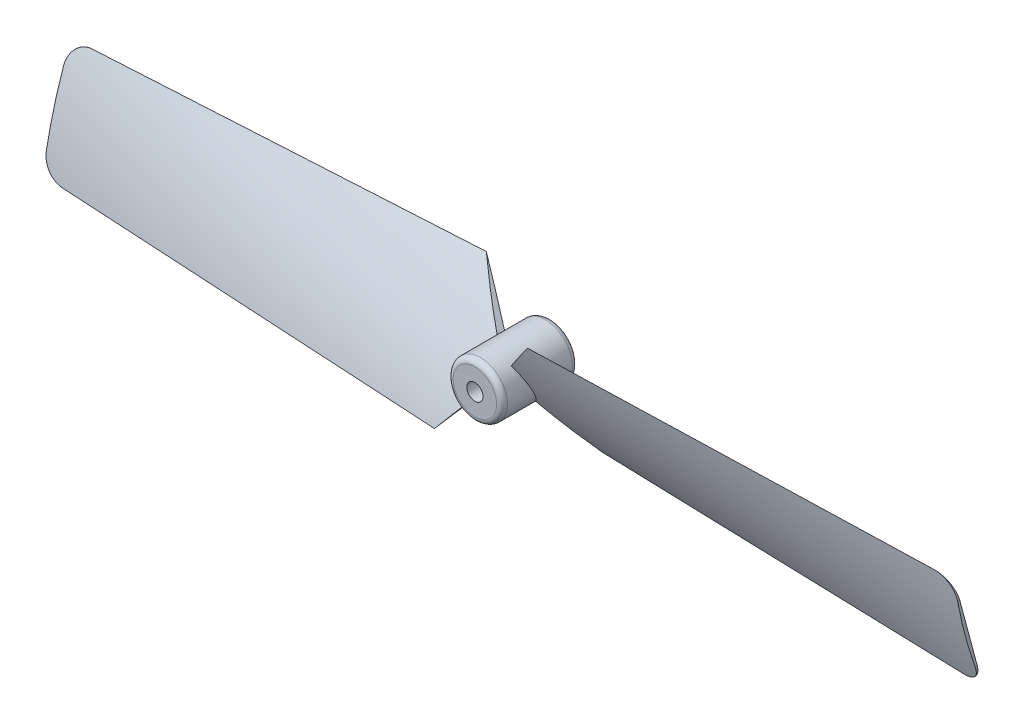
ISO-10303-21;
HEADER;
FILE_DESCRIPTION(('STEP AP214'),'2;1');
FILE_NAME('part.step','',(''),(''),'','','');
FILE_SCHEMA(('AUTOMOTIVE_DESIGN { 1 0 10303 214 1 1 1 1 }'));
ENDSEC;
DATA;
#1=APPLICATION_CONTEXT('core data for automotive mechanical design processes');
#2=APPLICATION_PROTOCOL_DEFINITION('international standard','automotive_design',2000,#1);
#3=PRODUCT_CONTEXT('',#1,'mechanical');
#4=PRODUCT('Part','Part','',(#3));
#5=PRODUCT_RELATED_PRODUCT_CATEGORY('part','',(#4));
#6=PRODUCT_DEFINITION_FORMATION('','',#4);
#7=PRODUCT_DEFINITION_CONTEXT('part definition',#1,'design');
#8=PRODUCT_DEFINITION('design','',#6,#7);
#9=PRODUCT_DEFINITION_SHAPE('','',#8);
#10=(LENGTH_UNIT() NAMED_UNIT(*) SI_UNIT(.MILLI.,.METRE.));
#11=(NAMED_UNIT(*) PLANE_ANGLE_UNIT() SI_UNIT($,.RADIAN.));
#12=(NAMED_UNIT(*) SI_UNIT($,.STERADIAN.) SOLID_ANGLE_UNIT());
#13=UNCERTAINTY_MEASURE_WITH_UNIT(LENGTH_MEASURE(1.E-05),#10,'distance_accuracy_value','');
#14=(GEOMETRIC_REPRESENTATION_CONTEXT(3) GLOBAL_UNCERTAINTY_ASSIGNED_CONTEXT((#13)) GLOBAL_UNIT_ASSIGNED_CONTEXT((#10,
#11,#12)) REPRESENTATION_CONTEXT('',''));
#15=CARTESIAN_POINT('',(0.,0.,0.));
#16=DIRECTION('',(0.,0.,1.));
#17=DIRECTION('',(1.,0.,0.));
#18=AXIS2_PLACEMENT_3D('',#15,#16,#17);
#19=CARTESIAN_POINT('',(-42.0000000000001,-10.2715624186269,-38.3339928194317));
#20=DIRECTION('',(-1.,0.,0.));
#21=DIRECTION('',(0.,0.,-1.));
#22=AXIS2_PLACEMENT_3D('',#19,#20,#21);
#23=PLANE('',#22);
#24=DIRECTION('',(0.,0.,1.));
#25=VECTOR('',#24,1.);
#26=CARTESIAN_POINT('',(-42.,-2.99999999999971,-3.5));
#27=LINE('',#26,#25);
#28=CARTESIAN_POINT('',(-42.,-2.99999999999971,0.99950918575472));
#29=VERTEX_POINT('',#28);
#30=CARTESIAN_POINT('',(-42.,-2.99999999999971,0.803847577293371));
#31=VERTEX_POINT('',#30);
#32=EDGE_CURVE('E141',#29,#31,#27,.F.);
#33=ORIENTED_EDGE('',*,*,#32,.F.);
#34=CARTESIAN_POINT('',(-42.0000000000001,-10.2715624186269,-38.3339928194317));
#35=DIRECTION('',(-1.,0.,0.));
#36=DIRECTION('',(0.,0.,-1.));
#37=AXIS2_PLACEMENT_3D('',#34,#35,#36);
#38=CIRCLE('',#37,40.);
#39=CARTESIAN_POINT('',(-42.,3.00000000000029,-0.599848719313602));
#40=VERTEX_POINT('',#39);
#41=EDGE_CURVE('E147',#29,#40,#38,.T.);
#42=ORIENTED_EDGE('',*,*,#41,.T.);
#43=DIRECTION('',(0.,0.,1.));
#44=VECTOR('',#43,1.);
#45=CARTESIAN_POINT('',(-42.,3.00000000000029,-3.5));
#46=LINE('',#45,#44);
#47=CARTESIAN_POINT('',(-42.,3.00000000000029,-0.803847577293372));
#48=VERTEX_POINT('',#47);
#49=EDGE_CURVE('E132',#40,#48,#46,.F.);
#50=ORIENTED_EDGE('',*,*,#49,.T.);
#51=DIRECTION('',(0.,-0.965925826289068,0.258819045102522));
#52=VECTOR('',#51,1.);
#53=CARTESIAN_POINT('',(-42.,-4.82962913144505,1.29409522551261));
#54=LINE('',#53,#52);
#55=EDGE_CURVE('E151',#48,#31,#54,.T.);
#56=ORIENTED_EDGE('',*,*,#55,.T.);
#57=EDGE_LOOP('',(#33,#42,#50,#56));
#58=FACE_BOUND('',#57,.T.);
#59=ADVANCED_FACE('F31',(#58),#23,.T.);
#60=CARTESIAN_POINT('',(42.,10.2715624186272,-38.3339928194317));
#61=DIRECTION('',(1.,0.,0.));
#62=DIRECTION('',(0.,0.,-1.));
#63=AXIS2_PLACEMENT_3D('',#60,#61,#62);
#64=PLANE('',#63);
#65=DIRECTION('',(0.,0.,1.));
#66=VECTOR('',#65,1.);
#67=CARTESIAN_POINT('',(42.,3.,-3.5));
#68=LINE('',#67,#66);
#69=CARTESIAN_POINT('',(42.,3.,0.99950918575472));
#70=VERTEX_POINT('',#69);
#71=CARTESIAN_POINT('',(42.,3.,0.803847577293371));
#72=VERTEX_POINT('',#71);
#73=EDGE_CURVE('E282',#70,#72,#68,.F.);
#74=ORIENTED_EDGE('',*,*,#73,.F.);
#75=CARTESIAN_POINT('',(42.,10.2715624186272,-38.3339928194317));
#76=DIRECTION('',(1.,0.,0.));
#77=DIRECTION('',(0.,0.,-1.));
#78=AXIS2_PLACEMENT_3D('',#75,#76,#77);
#79=CIRCLE('',#78,40.);
#80=CARTESIAN_POINT('',(42.,-3.,-0.599848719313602));
#81=VERTEX_POINT('',#80);
#82=EDGE_CURVE('E439',#70,#81,#79,.T.);
#83=ORIENTED_EDGE('',*,*,#82,.T.);
#84=DIRECTION('',(0.,0.,1.));
#85=VECTOR('',#84,1.);
#86=CARTESIAN_POINT('',(42.,-3.,-3.5));
#87=LINE('',#86,#85);
#88=CARTESIAN_POINT('',(42.,-3.,-0.803847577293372));
#89=VERTEX_POINT('',#88);
#90=EDGE_CURVE('E419',#81,#89,#87,.F.);
#91=ORIENTED_EDGE('',*,*,#90,.T.);
#92=DIRECTION('',(0.,0.965925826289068,0.258819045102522));
#93=VECTOR('',#92,1.);
#94=CARTESIAN_POINT('',(42.,4.82962913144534,1.29409522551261));
#95=LINE('',#94,#93);
#96=EDGE_CURVE('E435',#89,#72,#95,.T.);
#97=ORIENTED_EDGE('',*,*,#96,.T.);
#98=EDGE_LOOP('',(#74,#83,#91,#97));
#99=FACE_BOUND('',#98,.T.);
#100=ADVANCED_FACE('F437',(#99),#64,.T.);
#101=CARTESIAN_POINT('',(0.,0.,3.5));
#102=DIRECTION('',(0.,0.,-1.));
#103=DIRECTION('',(-1.,0.,0.));
#104=AXIS2_PLACEMENT_3D('',#101,#102,#103);
#105=CYLINDRICAL_SURFACE('',#104,2.5);
#106=CARTESIAN_POINT('',(0.,0.,-3.));
#107=DIRECTION('',(0.,0.,1.));
#108=DIRECTION('',(1.,0.,0.));
#109=AXIS2_PLACEMENT_3D('',#106,#107,#108);
#110=CIRCLE('',#109,2.5);
#111=CARTESIAN_POINT('',(2.5,0.,-3.));
#112=VERTEX_POINT('',#111);
#113=EDGE_CURVE('E691',#112,#112,#110,.T.);
#114=ORIENTED_EDGE('',*,*,#113,.T.);
#115=EDGE_LOOP('',(#114));
#116=FACE_BOUND('',#115,.T.);
#117=CARTESIAN_POINT('',(0.,0.,3.));
#118=DIRECTION('',(0.,0.,1.));
#119=DIRECTION('',(1.,0.,0.));
#120=AXIS2_PLACEMENT_3D('',#117,#118,#119);
#121=CIRCLE('',#120,2.5);
#122=CARTESIAN_POINT('',(2.5,0.,3.));
#123=VERTEX_POINT('',#122);
#124=EDGE_CURVE('E689',#123,#123,#121,.F.);
#125=ORIENTED_EDGE('',*,*,#124,.T.);
#126=EDGE_LOOP('',(#125));
#127=FACE_BOUND('',#126,.T.);
#128=DIRECTION('',(0.,0.,1.));
#129=VECTOR('',#128,1.);
#130=CARTESIAN_POINT('',(-1.76789854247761,1.76763535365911,-36.5));
#131=LINE('',#130,#129);
#132=CARTESIAN_POINT('',(-1.76789854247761,1.76763535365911,-0.999909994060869));
#133=VERTEX_POINT('',#132);
#134=CARTESIAN_POINT('',(-1.76789854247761,1.76763535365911,-0.315567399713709));
#135=VERTEX_POINT('',#134);
#136=EDGE_CURVE('E263',#133,#135,#131,.T.);
#137=ORIENTED_EDGE('',*,*,#136,.T.);
#138=CARTESIAN_POINT('',(0.,2.5,-0.810663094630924));
#139=CARTESIAN_POINT('',(-0.0621569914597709,2.50001221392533,-0.810355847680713));
#140=CARTESIAN_POINT('',(-0.124295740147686,2.4976822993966,-0.808409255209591));
#141=CARTESIAN_POINT('',(-0.248016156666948,2.48843681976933,-0.801342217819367));
#142=CARTESIAN_POINT('',(-0.309598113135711,2.48152378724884,-0.796223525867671));
#143=CARTESIAN_POINT('',(-0.431398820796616,2.46326373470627,-0.782955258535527));
#144=CARTESIAN_POINT('',(-0.491623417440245,2.45194273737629,-0.774823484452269));
#145=CARTESIAN_POINT('',(-0.610638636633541,2.42504592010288,-0.755696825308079));
#146=CARTESIAN_POINT('',(-0.669429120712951,2.40946969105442,-0.744701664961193));
#147=CARTESIAN_POINT('',(-0.842835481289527,2.35672873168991,-0.707753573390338));
#148=CARTESIAN_POINT('',(-0.95483038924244,2.31349863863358,-0.677798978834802));
#149=CARTESIAN_POINT('',(-1.16934008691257,2.21285750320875,-0.609018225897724));
#150=CARTESIAN_POINT('',(-1.27184168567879,2.15542712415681,-0.570179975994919));
#151=CARTESIAN_POINT('',(-1.47336285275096,2.0235597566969,-0.48219162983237));
#152=CARTESIAN_POINT('',(-1.57149583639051,1.94814924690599,-0.432475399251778));
#153=CARTESIAN_POINT('',(-1.75386187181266,1.78574900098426,-0.326978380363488));
#154=CARTESIAN_POINT('',(-1.83809053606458,1.69875562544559,-0.271195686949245));
#155=CARTESIAN_POINT('',(-2.00485584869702,1.50001883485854,-0.145670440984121));
#156=CARTESIAN_POINT('',(-2.0847737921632,1.38656647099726,-0.0751503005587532));
#157=CARTESIAN_POINT('',(-2.22416792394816,1.14977367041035,0.0694110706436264));
#158=CARTESIAN_POINT('',(-2.28363175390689,1.02642731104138,0.143454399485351));
#159=CARTESIAN_POINT('',(-2.38793304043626,0.755929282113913,0.302930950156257));
#160=CARTESIAN_POINT('',(-2.42984333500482,0.607773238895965,0.388588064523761));
#161=CARTESIAN_POINT('',(-2.48593688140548,0.306067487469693,0.55957250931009));
#162=CARTESIAN_POINT('',(-2.50010910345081,0.152515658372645,0.644899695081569));
#163=CARTESIAN_POINT('',(-2.49988467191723,-0.163044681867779,0.816968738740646));
#164=CARTESIAN_POINT('',(-2.48415034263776,-0.325118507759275,0.903596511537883));
#165=CARTESIAN_POINT('',(-2.42071204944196,-0.645615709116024,1.07188588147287));
#166=CARTESIAN_POINT('',(-2.37301275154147,-0.804039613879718,1.15354820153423));
#167=CARTESIAN_POINT('',(-2.24840562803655,-1.10450615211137,1.30619311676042));
#168=CARTESIAN_POINT('',(-2.17289117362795,-1.24696397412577,1.37748915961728));
#169=CARTESIAN_POINT('',(-1.99348020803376,-1.51733513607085,1.51151313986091));
#170=CARTESIAN_POINT('',(-1.88960330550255,-1.64525843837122,1.57424695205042));
#171=CARTESIAN_POINT('',(-1.66704359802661,-1.86907152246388,1.68365775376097));
#172=CARTESIAN_POINT('',(-1.55074622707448,-1.96685902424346,1.73129881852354));
#173=CARTESIAN_POINT('',(-1.29979888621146,-2.14098622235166,1.81657496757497));
#174=CARTESIAN_POINT('',(-1.16515454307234,-2.21733247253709,1.85421310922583));
#175=CARTESIAN_POINT('',(-0.895776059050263,-2.33819238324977,1.91498868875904));
#176=CARTESIAN_POINT('',(-0.762370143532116,-2.38510900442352,1.93919272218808));
#177=CARTESIAN_POINT('',(-0.557041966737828,-2.43817958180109,1.96794110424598));
#178=CARTESIAN_POINT('',(-0.487768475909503,-2.45298235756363,1.97626181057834));
#179=CARTESIAN_POINT('',(-0.347973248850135,-2.47667643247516,1.99032174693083));
#180=CARTESIAN_POINT('',(-0.277452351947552,-2.48557156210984,1.99606264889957));
#181=CARTESIAN_POINT('',(-0.172267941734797,-2.49429645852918,2.00261882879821));
#182=CARTESIAN_POINT('',(-0.137840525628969,-2.49643567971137,2.00444820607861));
#183=CARTESIAN_POINT('',(-0.068946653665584,-2.49928639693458,2.00747591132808));
#184=CARTESIAN_POINT('',(-0.0344803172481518,-2.49999985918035,2.00867510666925));
#185=CARTESIAN_POINT('',(0.,-2.50000000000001,2.00955818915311));
#186=B_SPLINE_CURVE_WITH_KNOTS('',3,(#138,#139,#140,#141,#142,#143,#144,#145,#146,#147,#148,
#149,#150,#151,#152,#153,#154,#155,#156,#157,#158,#159,#160,#161,#162,#163,#164,#165,#166,#167,
#168,#169,#170,#171,#172,#173,#174,#175,#176,#177,#178,#179,#180,#181,#182,#183,#184,#185),
.UNSPECIFIED.,.F.,.F.,(4,2,2,2,2,2,2,2,2,2,2,2,2,2,2,2,2,2,2,2,2,2,2,4),(0.,0.186392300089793,
0.372681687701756,0.557887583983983,0.743111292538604,1.11252104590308,1.48243662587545,
1.88104122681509,2.27977136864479,2.7449165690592,3.21034231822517,3.73659465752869,
4.26305621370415,4.81362077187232,5.36410498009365,5.89010687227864,6.41574602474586,
6.89082195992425,7.36575252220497,7.79367053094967,8.00739702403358,8.22098480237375,
8.32458216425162,8.4280365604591),.UNSPECIFIED.);
#187=CARTESIAN_POINT('',(-1.56256547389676,-1.95150945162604,1.72386509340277));
#188=VERTEX_POINT('',#187);
#189=EDGE_CURVE('E168',#135,#188,#186,.T.);
#190=ORIENTED_EDGE('',*,*,#189,.T.);
#191=DIRECTION('',(0.,0.,1.));
#192=VECTOR('',#191,1.);
#193=CARTESIAN_POINT('',(-1.56256547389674,-1.95150945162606,-36.5));
#194=LINE('',#193,#192);
#195=CARTESIAN_POINT('',(-1.56256547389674,-1.95150945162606,1.10657985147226));
#196=VERTEX_POINT('',#195);
#197=EDGE_CURVE('E156',#196,#188,#194,.T.);
#198=ORIENTED_EDGE('',*,*,#197,.F.);
#199=CARTESIAN_POINT('',(0.,-2.5,1.44337567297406));
#200=CARTESIAN_POINT('',(-0.0642289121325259,-2.5000109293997,1.44232636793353));
#201=CARTESIAN_POINT('',(-0.128425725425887,-2.49752510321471,1.43983582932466));
#202=CARTESIAN_POINT('',(-0.256245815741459,-2.48765571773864,1.43205399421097));
#203=CARTESIAN_POINT('',(-0.319869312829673,-2.48027412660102,1.42676382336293));
#204=CARTESIAN_POINT('',(-0.445807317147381,-2.46075201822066,1.41349280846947));
#205=CARTESIAN_POINT('',(-0.50812636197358,-2.44863264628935,1.40552394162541));
#206=CARTESIAN_POINT('',(-0.631290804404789,-2.41980945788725,1.38701440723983));
#207=CARTESIAN_POINT('',(-0.692136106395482,-2.40310534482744,1.37647357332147));
#208=CARTESIAN_POINT('',(-0.871695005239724,-2.34645400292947,1.34122207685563));
#209=CARTESIAN_POINT('',(-0.987699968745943,-2.29992515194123,1.31285342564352));
#210=CARTESIAN_POINT('',(-1.20962757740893,-2.19137218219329,1.24767177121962));
#211=CARTESIAN_POINT('',(-1.31554088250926,-2.1293338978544,1.21085105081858));
#212=CARTESIAN_POINT('',(-1.52124289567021,-1.98803256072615,1.12778371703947));
#213=CARTESIAN_POINT('',(-1.62031347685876,-1.90797558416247,1.08111242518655));
#214=CARTESIAN_POINT('',(-1.80358596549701,-1.73577421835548,0.981423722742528));
#215=CARTESIAN_POINT('',(-1.88778289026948,-1.64362579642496,0.928404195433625));
#216=CARTESIAN_POINT('',(-2.04996565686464,-1.43766798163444,0.810501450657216));
#217=CARTESIAN_POINT('',(-2.12586508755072,-1.32259050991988,0.744963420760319));
#218=CARTESIAN_POINT('',(-2.25704929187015,-1.08366416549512,0.609430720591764));
#219=CARTESIAN_POINT('',(-2.31232425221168,-0.959811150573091,0.539433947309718));
#220=CARTESIAN_POINT('',(-2.40713287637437,-0.691542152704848,0.388205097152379));
#221=CARTESIAN_POINT('',(-2.44408139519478,-0.54641186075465,0.306614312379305));
#222=CARTESIAN_POINT('',(-2.49167368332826,-0.252538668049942,0.14161701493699));
#223=CARTESIAN_POINT('',(-2.50225990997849,-0.103788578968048,0.0582069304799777));
#224=CARTESIAN_POINT('',(-2.49674363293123,0.204196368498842,-0.114517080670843));
#225=CARTESIAN_POINT('',(-2.47863893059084,0.363404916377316,-0.203818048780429));
#226=CARTESIAN_POINT('',(-2.41200928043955,0.676576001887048,-0.379793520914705));
#227=CARTESIAN_POINT('',(-2.36354362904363,0.830548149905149,-0.466472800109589));
#228=CARTESIAN_POINT('',(-2.26847526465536,1.05383963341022,-0.592612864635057));
#229=CARTESIAN_POINT('',(-2.23306225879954,1.12698525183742,-0.634009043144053));
#230=CARTESIAN_POINT('',(-2.15486000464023,1.27012513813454,-0.715198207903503));
#231=CARTESIAN_POINT('',(-2.11207523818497,1.34012128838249,-0.754992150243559));
#232=CARTESIAN_POINT('',(-2.01925110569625,1.47628469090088,-0.83261582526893));
#233=CARTESIAN_POINT('',(-1.9692120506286,1.54245210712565,-0.870445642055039));
#234=CARTESIAN_POINT('',(-1.86205994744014,1.6702344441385,-0.943746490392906));
#235=CARTESIAN_POINT('',(-1.80494665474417,1.73184920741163,-0.979217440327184));
#236=CARTESIAN_POINT('',(-1.68912042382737,1.84467809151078,-1.04443532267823));
#237=CARTESIAN_POINT('',(-1.63096437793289,1.89633101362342,-1.0744122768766));
#238=CARTESIAN_POINT('',(-1.50927325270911,1.99454390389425,-1.13166658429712));
#239=CARTESIAN_POINT('',(-1.4457390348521,2.04110468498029,-1.15894436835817));
#240=CARTESIAN_POINT('',(-1.31369709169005,2.12848909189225,-1.21042281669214));
#241=CARTESIAN_POINT('',(-1.24519096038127,2.16931454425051,-1.23462446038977));
#242=CARTESIAN_POINT('',(-1.10370133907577,2.24460717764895,-1.27957668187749));
#243=CARTESIAN_POINT('',(-1.03071884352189,2.27907576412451,-1.30032802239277));
#244=CARTESIAN_POINT('',(-0.89107777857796,2.33685511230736,-1.33545379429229));
#245=CARTESIAN_POINT('',(-0.82490320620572,2.36104503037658,-1.35031134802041));
#246=CARTESIAN_POINT('',(-0.690186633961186,2.40387918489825,-1.37694589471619));
#247=CARTESIAN_POINT('',(-0.621645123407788,2.42252456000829,-1.38872352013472));
#248=CARTESIAN_POINT('',(-0.482953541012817,2.4539354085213,-1.40897351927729));
#249=CARTESIAN_POINT('',(-0.412808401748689,2.46671688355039,-1.41745487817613));
#250=CARTESIAN_POINT('',(-0.271395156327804,2.48624844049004,-1.43099348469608));
#251=CARTESIAN_POINT('',(-0.200128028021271,2.49300350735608,-1.43605356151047));
#252=CARTESIAN_POINT('',(-0.107229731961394,2.49779168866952,-1.44033953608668));
#253=CARTESIAN_POINT('',(-0.0857862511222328,2.49862001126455,-1.44116962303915));
#254=CARTESIAN_POINT('',(-0.0428970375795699,2.49972377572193,-1.44251121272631));
#255=CARTESIAN_POINT('',(-0.0214513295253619,2.49999978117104,-1.4430230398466));
#256=CARTESIAN_POINT('',(0.,2.5,-1.44337567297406));
#257=B_SPLINE_CURVE_WITH_KNOTS('',3,(#199,#200,#201,#202,#203,#204,#205,#206,#207,#208,#209,
#210,#211,#212,#213,#214,#215,#216,#217,#218,#219,#220,#221,#222,#223,#224,#225,#226,#227,#228,
#229,#230,#231,#232,#233,#234,#235,#236,#237,#238,#239,#240,#241,#242,#243,#244,#245,#246,#247,
#248,#249,#250,#251,#252,#253,#254,#255,#256),.UNSPECIFIED.,.F.,.F.,(4,2,2,2,2,2,2,2,2,2,2,2,2,
2,2,2,2,2,2,2,2,2,2,2,2,2,2,2,4),(0.,0.192634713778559,0.385192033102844,0.576899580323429,
0.768619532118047,1.15124999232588,1.5342312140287,1.93956252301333,2.34502936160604,
2.80109693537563,3.25738123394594,3.76683984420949,4.27740951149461,4.82520568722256,
5.37193531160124,5.64524424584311,5.91838759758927,6.19151924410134,6.46466033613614,
6.71438521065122,6.96407015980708,7.21367541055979,7.46322540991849,7.6789444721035,
7.89461920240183,8.10970183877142,8.32460639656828,8.38902649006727,8.45338081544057),.UNSPECIFIED.);
#258=EDGE_CURVE('E175',#196,#133,#257,.T.);
#259=ORIENTED_EDGE('',*,*,#258,.T.);
#260=EDGE_LOOP('',(#137,#190,#198,#259));
#261=FACE_BOUND('',#260,.T.);
#262=DIRECTION('',(0.,0.,1.));
#263=VECTOR('',#262,1.);
#264=CARTESIAN_POINT('',(1.76789854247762,-1.76763535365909,-36.5));
#265=LINE('',#264,#263);
#266=CARTESIAN_POINT('',(1.76789854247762,-1.76763535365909,-0.999909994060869));
#267=VERTEX_POINT('',#266);
#268=CARTESIAN_POINT('',(1.76789854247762,-1.76763535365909,-0.315567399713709));
#269=VERTEX_POINT('',#268);
#270=EDGE_CURVE('E393',#267,#269,#265,.T.);
#271=ORIENTED_EDGE('',*,*,#270,.T.);
#272=CARTESIAN_POINT('',(0.,-2.5,-0.810663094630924));
#273=CARTESIAN_POINT('',(0.0621569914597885,-2.50001221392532,-0.810355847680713));
#274=CARTESIAN_POINT('',(0.124295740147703,-2.4976822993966,-0.808409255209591));
#275=CARTESIAN_POINT('',(0.248016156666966,-2.48843681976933,-0.801342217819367));
#276=CARTESIAN_POINT('',(0.309598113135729,-2.48152378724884,-0.796223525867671));
#277=CARTESIAN_POINT('',(0.431398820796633,-2.46326373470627,-0.782955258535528));
#278=CARTESIAN_POINT('',(0.491623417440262,-2.45194273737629,-0.774823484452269));
#279=CARTESIAN_POINT('',(0.610638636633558,-2.42504592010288,-0.755696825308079));
#280=CARTESIAN_POINT('',(0.669429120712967,-2.40946969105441,-0.744701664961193));
#281=CARTESIAN_POINT('',(0.842835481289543,-2.3567287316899,-0.707753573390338));
#282=CARTESIAN_POINT('',(0.954830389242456,-2.31349863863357,-0.677798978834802));
#283=CARTESIAN_POINT('',(1.16934008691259,-2.21285750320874,-0.609018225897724));
#284=CARTESIAN_POINT('',(1.27184168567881,-2.1554271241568,-0.570179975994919));
#285=CARTESIAN_POINT('',(1.47336285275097,-2.02355975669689,-0.482191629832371));
#286=CARTESIAN_POINT('',(1.57149583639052,-1.94814924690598,-0.432475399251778));
#287=CARTESIAN_POINT('',(1.75386187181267,-1.78574900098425,-0.326978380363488));
#288=CARTESIAN_POINT('',(1.83809053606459,-1.69875562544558,-0.271195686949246));
#289=CARTESIAN_POINT('',(2.00485584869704,-1.50001883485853,-0.145670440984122));
#290=CARTESIAN_POINT('',(2.08477379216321,-1.38656647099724,-0.075150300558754));
#291=CARTESIAN_POINT('',(2.22416792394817,-1.14977367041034,0.0694110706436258));
#292=CARTESIAN_POINT('',(2.2836317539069,-1.02642731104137,0.143454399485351));
#293=CARTESIAN_POINT('',(2.38793304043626,-0.755929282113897,0.302930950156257));
#294=CARTESIAN_POINT('',(2.42984333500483,-0.607773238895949,0.388588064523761));
#295=CARTESIAN_POINT('',(2.48593688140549,-0.306067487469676,0.55957250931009));
#296=CARTESIAN_POINT('',(2.50010910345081,-0.152515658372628,0.644899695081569));
#297=CARTESIAN_POINT('',(2.49988467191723,0.163044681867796,0.816968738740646));
#298=CARTESIAN_POINT('',(2.48415034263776,0.325118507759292,0.903596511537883));
#299=CARTESIAN_POINT('',(2.42071204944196,0.64561570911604,1.07188588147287));
#300=CARTESIAN_POINT('',(2.37301275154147,0.804039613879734,1.15354820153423));
#301=CARTESIAN_POINT('',(2.24840562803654,1.10450615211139,1.30619311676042));
#302=CARTESIAN_POINT('',(2.17289117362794,1.24696397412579,1.37748915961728));
#303=CARTESIAN_POINT('',(1.99348020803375,1.51733513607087,1.51151313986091));
#304=CARTESIAN_POINT('',(1.88960330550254,1.64525843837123,1.57424695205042));
#305=CARTESIAN_POINT('',(1.66704359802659,1.86907152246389,1.68365775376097));
#306=CARTESIAN_POINT('',(1.55074622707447,1.96685902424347,1.73129881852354));
#307=CARTESIAN_POINT('',(1.29979888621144,2.14098622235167,1.81657496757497));
#308=CARTESIAN_POINT('',(1.16515454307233,2.2173324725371,1.85421310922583));
#309=CARTESIAN_POINT('',(0.895776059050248,2.33819238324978,1.91498868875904));
#310=CARTESIAN_POINT('',(0.762370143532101,2.38510900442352,1.93919272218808));
#311=CARTESIAN_POINT('',(0.557041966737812,2.4381795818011,1.96794110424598));
#312=CARTESIAN_POINT('',(0.487768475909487,2.45298235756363,1.97626181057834));
#313=CARTESIAN_POINT('',(0.347973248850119,2.47667643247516,1.99032174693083));
#314=CARTESIAN_POINT('',(0.277452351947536,2.48557156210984,1.99606264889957));
#315=CARTESIAN_POINT('',(0.172267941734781,2.49429645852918,2.00261882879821));
#316=CARTESIAN_POINT('',(0.137840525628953,2.49643567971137,2.00444820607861));
#317=CARTESIAN_POINT('',(0.0689466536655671,2.49928639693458,2.00747591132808));
#318=CARTESIAN_POINT('',(0.0344803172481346,2.49999985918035,2.00867510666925));
#319=CARTESIAN_POINT('',(0.,2.50000000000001,2.00955818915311));
#320=B_SPLINE_CURVE_WITH_KNOTS('',3,(#272,#273,#274,#275,#276,#277,#278,#279,#280,#281,#282,
#283,#284,#285,#286,#287,#288,#289,#290,#291,#292,#293,#294,#295,#296,#297,#298,#299,#300,#301,
#302,#303,#304,#305,#306,#307,#308,#309,#310,#311,#312,#313,#314,#315,#316,#317,#318,#319),
.UNSPECIFIED.,.F.,.F.,(4,2,2,2,2,2,2,2,2,2,2,2,2,2,2,2,2,2,2,2,2,2,2,4),(0.,0.186392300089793,
0.372681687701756,0.557887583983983,0.743111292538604,1.11252104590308,1.48243662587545,
1.88104122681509,2.27977136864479,2.7449165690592,3.21034231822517,3.73659465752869,
4.26305621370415,4.81362077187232,5.36410498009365,5.89010687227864,6.41574602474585,
6.89082195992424,7.36575252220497,7.79367053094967,8.00739702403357,8.22098480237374,
8.32458216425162,8.4280365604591),.UNSPECIFIED.);
#321=CARTESIAN_POINT('',(1.56256547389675,1.95150945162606,1.72386509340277));
#322=VERTEX_POINT('',#321);
#323=EDGE_CURVE('E444',#269,#322,#320,.T.);
#324=ORIENTED_EDGE('',*,*,#323,.T.);
#325=DIRECTION('',(0.,0.,1.));
#326=VECTOR('',#325,1.);
#327=CARTESIAN_POINT('',(1.56256547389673,1.95150945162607,-36.5));
#328=LINE('',#327,#326);
#329=CARTESIAN_POINT('',(1.56256547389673,1.95150945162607,1.10657985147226));
#330=VERTEX_POINT('',#329);
#331=EDGE_CURVE('E458',#330,#322,#328,.T.);
#332=ORIENTED_EDGE('',*,*,#331,.F.);
#333=CARTESIAN_POINT('',(0.,2.5,1.44337567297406));
#334=CARTESIAN_POINT('',(0.0642289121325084,2.5000109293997,1.44232636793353));
#335=CARTESIAN_POINT('',(0.12842572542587,2.49752510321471,1.43983582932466));
#336=CARTESIAN_POINT('',(0.256245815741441,2.48765571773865,1.43205399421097));
#337=CARTESIAN_POINT('',(0.319869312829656,2.48027412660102,1.42676382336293));
#338=CARTESIAN_POINT('',(0.445807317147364,2.46075201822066,1.41349280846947));
#339=CARTESIAN_POINT('',(0.508126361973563,2.44863264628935,1.4055239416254));
#340=CARTESIAN_POINT('',(0.631290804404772,2.41980945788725,1.38701440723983));
#341=CARTESIAN_POINT('',(0.692136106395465,2.40310534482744,1.37647357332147));
#342=CARTESIAN_POINT('',(0.871695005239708,2.34645400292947,1.34122207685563));
#343=CARTESIAN_POINT('',(0.987699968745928,2.29992515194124,1.31285342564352));
#344=CARTESIAN_POINT('',(1.20962757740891,2.1913721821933,1.24767177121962));
#345=CARTESIAN_POINT('',(1.31554088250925,2.12933389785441,1.21085105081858));
#346=CARTESIAN_POINT('',(1.52124289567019,1.98803256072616,1.12778371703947));
#347=CARTESIAN_POINT('',(1.62031347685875,1.90797558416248,1.08111242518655));
#348=CARTESIAN_POINT('',(1.803585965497,1.73577421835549,0.981423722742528));
#349=CARTESIAN_POINT('',(1.88778289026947,1.64362579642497,0.928404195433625));
#350=CARTESIAN_POINT('',(2.04996565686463,1.43766798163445,0.810501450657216));
#351=CARTESIAN_POINT('',(2.12586508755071,1.3225905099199,0.744963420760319));
#352=CARTESIAN_POINT('',(2.25704929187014,1.08366416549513,0.609430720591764));
#353=CARTESIAN_POINT('',(2.31232425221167,0.959811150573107,0.539433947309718));
#354=CARTESIAN_POINT('',(2.40713287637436,0.691542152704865,0.388205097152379));
#355=CARTESIAN_POINT('',(2.44408139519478,0.546411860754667,0.306614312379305));
#356=CARTESIAN_POINT('',(2.49167368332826,0.252538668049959,0.141617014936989));
#357=CARTESIAN_POINT('',(2.50225990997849,0.103788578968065,0.0582069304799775));
#358=CARTESIAN_POINT('',(2.49674363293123,-0.204196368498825,-0.114517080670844));
#359=CARTESIAN_POINT('',(2.47863893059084,-0.363404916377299,-0.203818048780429));
#360=CARTESIAN_POINT('',(2.41200928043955,-0.676576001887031,-0.379793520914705));
#361=CARTESIAN_POINT('',(2.36354362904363,-0.830548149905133,-0.466472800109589));
#362=CARTESIAN_POINT('',(2.26847526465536,-1.05383963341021,-0.592612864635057));
#363=CARTESIAN_POINT('',(2.23306225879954,-1.12698525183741,-0.634009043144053));
#364=CARTESIAN_POINT('',(2.15486000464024,-1.27012513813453,-0.715198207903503));
#365=CARTESIAN_POINT('',(2.11207523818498,-1.34012128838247,-0.754992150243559));
#366=CARTESIAN_POINT('',(2.01925110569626,-1.47628469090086,-0.83261582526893));
#367=CARTESIAN_POINT('',(1.96921205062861,-1.54245210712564,-0.870445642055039));
#368=CARTESIAN_POINT('',(1.86205994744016,-1.67023444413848,-0.943746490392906));
#369=CARTESIAN_POINT('',(1.80494665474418,-1.73184920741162,-0.979217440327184));
#370=CARTESIAN_POINT('',(1.68912042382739,-1.84467809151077,-1.04443532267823));
#371=CARTESIAN_POINT('',(1.6309643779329,-1.89633101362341,-1.07441227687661));
#372=CARTESIAN_POINT('',(1.50927325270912,-1.99454390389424,-1.13166658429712));
#373=CARTESIAN_POINT('',(1.44573903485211,-2.04110468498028,-1.15894436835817));
#374=CARTESIAN_POINT('',(1.31369709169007,-2.12848909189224,-1.21042281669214));
#375=CARTESIAN_POINT('',(1.24519096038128,-2.16931454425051,-1.23462446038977));
#376=CARTESIAN_POINT('',(1.10370133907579,-2.24460717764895,-1.27957668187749));
#377=CARTESIAN_POINT('',(1.03071884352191,-2.2790757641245,-1.30032802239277));
#378=CARTESIAN_POINT('',(0.891077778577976,-2.33685511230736,-1.33545379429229));
#379=CARTESIAN_POINT('',(0.824903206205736,-2.36104503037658,-1.35031134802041));
#380=CARTESIAN_POINT('',(0.690186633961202,-2.40387918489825,-1.37694589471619));
#381=CARTESIAN_POINT('',(0.621645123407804,-2.42252456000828,-1.38872352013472));
#382=CARTESIAN_POINT('',(0.482953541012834,-2.4539354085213,-1.40897351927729));
#383=CARTESIAN_POINT('',(0.412808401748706,-2.46671688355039,-1.41745487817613));
#384=CARTESIAN_POINT('',(0.271395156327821,-2.48624844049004,-1.43099348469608));
#385=CARTESIAN_POINT('',(0.200128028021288,-2.49300350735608,-1.43605356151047));
#386=CARTESIAN_POINT('',(0.107229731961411,-2.49779168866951,-1.44033953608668));
#387=CARTESIAN_POINT('',(0.08578625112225,-2.49862001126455,-1.44116962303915));
#388=CARTESIAN_POINT('',(0.0428970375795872,-2.49972377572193,-1.44251121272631));
#389=CARTESIAN_POINT('',(0.0214513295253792,-2.49999978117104,-1.4430230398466));
#390=CARTESIAN_POINT('',(0.,-2.5,-1.44337567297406));
#391=B_SPLINE_CURVE_WITH_KNOTS('',3,(#333,#334,#335,#336,#337,#338,#339,#340,#341,#342,#343,
#344,#345,#346,#347,#348,#349,#350,#351,#352,#353,#354,#355,#356,#357,#358,#359,#360,#361,#362,
#363,#364,#365,#366,#367,#368,#369,#370,#371,#372,#373,#374,#375,#376,#377,#378,#379,#380,#381,
#382,#383,#384,#385,#386,#387,#388,#389,#390),.UNSPECIFIED.,.F.,.F.,(4,2,2,2,2,2,2,2,2,2,2,2,2,
2,2,2,2,2,2,2,2,2,2,2,2,2,2,2,4),(0.,0.192634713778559,0.385192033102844,0.576899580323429,
0.768619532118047,1.15124999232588,1.5342312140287,1.93956252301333,2.34502936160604,
2.80109693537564,3.25738123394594,3.76683984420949,4.27740951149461,4.82520568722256,
5.37193531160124,5.64524424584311,5.91838759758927,6.19151924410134,6.46466033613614,
6.71438521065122,6.96407015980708,7.21367541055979,7.4632254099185,7.6789444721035,
7.89461920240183,8.10970183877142,8.32460639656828,8.38902649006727,8.45338081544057),.UNSPECIFIED.);
#392=EDGE_CURVE('E341',#330,#267,#391,.T.);
#393=ORIENTED_EDGE('',*,*,#392,.T.);
#394=EDGE_LOOP('',(#271,#324,#332,#393));
#395=FACE_BOUND('',#394,.T.);
#396=ADVANCED_FACE('F33',(#116,#127,#261,#395),#105,.T.);
#397=CARTESIAN_POINT('',(0.,0.,3.5));
#398=DIRECTION('',(0.,0.,1.));
#399=DIRECTION('',(1.,0.,0.));
#400=AXIS2_PLACEMENT_3D('',#397,#398,#399);
#401=PLANE('',#400);
#402=CARTESIAN_POINT('',(0.,0.,3.5));
#403=DIRECTION('',(0.,0.,1.));
#404=DIRECTION('',(1.,0.,0.));
#405=AXIS2_PLACEMENT_3D('',#402,#403,#404);
#406=CIRCLE('',#405,2.);
#407=CARTESIAN_POINT('',(2.,0.,3.5));
#408=VERTEX_POINT('',#407);
#409=EDGE_CURVE('E11',#408,#408,#406,.T.);
#410=ORIENTED_EDGE('',*,*,#409,.T.);
#411=EDGE_LOOP('',(#410));
#412=FACE_BOUND('',#411,.T.);
#413=CARTESIAN_POINT('',(0.,0.,3.5));
#414=DIRECTION('',(0.,0.,1.));
#415=DIRECTION('',(1.,0.,0.));
#416=AXIS2_PLACEMENT_3D('',#413,#414,#415);
#417=CIRCLE('',#416,0.75);
#418=CARTESIAN_POINT('',(0.75,0.,3.5));
#419=VERTEX_POINT('',#418);
#420=EDGE_CURVE('E650',#419,#419,#417,.T.);
#421=ORIENTED_EDGE('',*,*,#420,.F.);
#422=EDGE_LOOP('',(#421));
#423=FACE_BOUND('',#422,.T.);
#424=ADVANCED_FACE('F471',(#412,#423),#401,.T.);
#425=CARTESIAN_POINT('',(0.,0.,-3.5));
#426=DIRECTION('',(0.,0.,1.));
#427=DIRECTION('',(1.,0.,0.));
#428=AXIS2_PLACEMENT_3D('',#425,#426,#427);
#429=PLANE('',#428);
#430=CARTESIAN_POINT('',(0.,0.,-3.5));
#431=DIRECTION('',(0.,0.,1.));
#432=DIRECTION('',(1.,0.,0.));
#433=AXIS2_PLACEMENT_3D('',#430,#431,#432);
#434=CIRCLE('',#433,2.);
#435=CARTESIAN_POINT('',(2.,0.,-3.5));
#436=VERTEX_POINT('',#435);
#437=EDGE_CURVE('E40',#436,#436,#434,.F.);
#438=ORIENTED_EDGE('',*,*,#437,.T.);
#439=EDGE_LOOP('',(#438));
#440=FACE_BOUND('',#439,.T.);
#441=CARTESIAN_POINT('',(0.,0.,-3.5));
#442=DIRECTION('',(0.,0.,1.));
#443=DIRECTION('',(1.,0.,0.));
#444=AXIS2_PLACEMENT_3D('',#441,#442,#443);
#445=CIRCLE('',#444,0.75);
#446=CARTESIAN_POINT('',(0.75,0.,-3.5));
#447=VERTEX_POINT('',#446);
#448=EDGE_CURVE('E386',#447,#447,#445,.T.);
#449=ORIENTED_EDGE('',*,*,#448,.T.);
#450=EDGE_LOOP('',(#449));
#451=FACE_BOUND('',#450,.T.);
#452=ADVANCED_FACE('F331',(#440,#451),#429,.F.);
#453=CARTESIAN_POINT('',(0.,-5.41265877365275,-3.12499999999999));
#454=CARTESIAN_POINT('',(42.,-4.82962913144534,-1.29409522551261));
#455=CARTESIAN_POINT('',(0.,5.41265877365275,3.12499999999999));
#456=CARTESIAN_POINT('',(42.,4.82962913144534,1.29409522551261));
#457=B_SPLINE_SURFACE_WITH_KNOTS('',1,1,((#453,#454),(#455,#456)),.UNSPECIFIED.,.F.,.F.,.F.,(2,
2),(2,2),(0.,1.),(0.,1.),.UNSPECIFIED.);
#458=CARTESIAN_POINT('',(42.,3.,0.803847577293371));
#459=CARTESIAN_POINT('',(41.9999988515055,3.05388062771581,0.818284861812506));
#460=CARTESIAN_POINT('',(41.9976513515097,3.10772069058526,0.832769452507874));
#461=CARTESIAN_POINT('',(41.9882885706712,3.2149859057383,0.861761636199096));
#462=CARTESIAN_POINT('',(41.9812733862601,3.26841106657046,0.876269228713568));
#463=CARTESIAN_POINT('',(41.9532816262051,3.4274641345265,0.919691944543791));
#464=CARTESIAN_POINT('',(41.9253587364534,3.53197527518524,0.948535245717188));
#465=CARTESIAN_POINT('',(41.8516935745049,3.73481115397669,1.00527999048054));
#466=CARTESIAN_POINT('',(41.8059402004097,3.83313199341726,1.03318083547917));
#467=CARTESIAN_POINT('',(41.6977853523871,4.02064049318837,1.08730908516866));
#468=CARTESIAN_POINT('',(41.6353898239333,4.10983139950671,1.11353708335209));
#469=CARTESIAN_POINT('',(41.4962849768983,4.27547633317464,1.16331855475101));
#470=CARTESIAN_POINT('',(41.4197285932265,4.35205130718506,1.1868966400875));
#471=CARTESIAN_POINT('',(41.2538937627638,4.49110277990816,1.23094601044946));
#472=CARTESIAN_POINT('',(41.1646123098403,4.55357593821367,1.25141655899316));
#473=CARTESIAN_POINT('',(40.9785587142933,4.66067029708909,1.28797235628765));
#474=CARTESIAN_POINT('',(40.8820677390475,4.70574401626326,1.30416471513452));
#475=CARTESIAN_POINT('',(40.6823070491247,4.77880093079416,1.33223884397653));
#476=CARTESIAN_POINT('',(40.5790478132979,4.8068098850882,1.34412709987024));
#477=CARTESIAN_POINT('',(40.4268992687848,4.83425916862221,1.3578351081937));
#478=CARTESIAN_POINT('',(40.3793906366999,4.84093769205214,1.3615938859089));
#479=CARTESIAN_POINT('',(40.2840032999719,4.85059255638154,1.36809308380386));
#480=CARTESIAN_POINT('',(40.2361252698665,4.85357452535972,1.3708350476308));
#481=CARTESIAN_POINT('',(40.1881534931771,4.85469698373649,1.37305535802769));
#482=B_SPLINE_CURVE_WITH_KNOTS('',3,(#458,#459,#460,#461,#462,#463,#464,#465,#466,#467,#468,
#469,#470,#471,#472,#473,#474,#475,#476,#477,#478,#479,#480,#481),.UNSPECIFIED.,.F.,.F.,(4,2,2,
2,2,2,2,2,2,2,2,4),(0.,0.167241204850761,0.334478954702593,0.668630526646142,1.00299048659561,
1.33723115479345,1.6680530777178,1.99895328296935,2.32055039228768,2.64166084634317,
2.78589944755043,2.92991817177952),.UNSPECIFIED.);
#483=CARTESIAN_POINT('',(40.1881534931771,4.85469698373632,1.3730617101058));
#484=VERTEX_POINT('',#483);
#485=EDGE_CURVE('E385',#72,#484,#482,.T.);
#486=CARTESIAN_POINT('',(40.1881534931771,-4.85469698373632,-1.37305535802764));
#487=CARTESIAN_POINT('',(40.2395271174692,-4.85349666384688,-1.37067804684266));
#488=CARTESIAN_POINT('',(40.2907964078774,-4.85016049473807,-1.36770149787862));
#489=CARTESIAN_POINT('',(40.3927942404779,-4.83926880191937,-1.36059356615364));
#490=CARTESIAN_POINT('',(40.4435228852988,-4.83171409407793,-1.35646240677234));
#491=CARTESIAN_POINT('',(40.5941365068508,-4.80285488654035,-1.3424280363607));
#492=CARTESIAN_POINT('',(40.692752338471,-4.77534763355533,-1.33086955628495));
#493=CARTESIAN_POINT('',(40.8835887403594,-4.70479623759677,-1.30384560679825));
#494=CARTESIAN_POINT('',(40.975810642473,-4.6617553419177,-1.28838095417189));
#495=CARTESIAN_POINT('',(41.1515679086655,-4.56154511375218,-1.25410133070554));
#496=CARTESIAN_POINT('',(41.2351012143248,-4.50437244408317,-1.23528556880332));
#497=CARTESIAN_POINT('',(41.3931901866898,-4.37618590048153,-1.19443928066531));
#498=CARTESIAN_POINT('',(41.4674961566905,-4.30488477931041,-1.17234494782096));
#499=CARTESIAN_POINT('',(41.6030548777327,-4.15141187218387,-1.12591443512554));
#500=CARTESIAN_POINT('',(41.6643038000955,-4.06923690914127,-1.10157760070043));
#501=CARTESIAN_POINT('',(41.7741366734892,-3.89338688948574,-1.05044439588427));
#502=CARTESIAN_POINT('',(41.8222222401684,-3.79941689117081,-1.02359268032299));
#503=CARTESIAN_POINT('',(41.9017239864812,-3.60498271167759,-0.968844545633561));
#504=CARTESIAN_POINT('',(41.9331478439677,-3.50452154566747,-0.940948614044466));
#505=CARTESIAN_POINT('',(41.9705402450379,-3.33619475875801,-0.894733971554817));
#506=CARTESIAN_POINT('',(41.9815823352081,-3.26938304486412,-0.876521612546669));
#507=CARTESIAN_POINT('',(41.996308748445,-3.13506395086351,-0.840129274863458));
#508=CARTESIAN_POINT('',(42.0000051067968,-3.06755789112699,-0.821949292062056));
#509=CARTESIAN_POINT('',(42.,-3.,-0.803847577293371));
#510=B_SPLINE_CURVE_WITH_KNOTS('',3,(#486,#487,#488,#489,#490,#491,#492,#493,#494,#495,#496,
#497,#498,#499,#500,#501,#502,#503,#504,#505,#506,#507,#508,#509),.UNSPECIFIED.,.F.,.F.,(4,2,2,
2,2,2,2,2,2,2,2,4),(0.,0.154228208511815,0.308426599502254,0.615924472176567,0.923358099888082,
1.23086439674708,1.54541986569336,1.86006744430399,2.18535638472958,2.51049529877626,
2.72050687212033,2.93017407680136),.UNSPECIFIED.);
#511=CARTESIAN_POINT('',(40.1881534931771,-4.85469698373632,-1.37304924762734));
#512=VERTEX_POINT('',#511);
#513=EDGE_CURVE('E387',#512,#89,#510,.T.);
#514=CARTESIAN_POINT('',(40.1881534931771,-4.85478056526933,-1.3730789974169));
#515=CARTESIAN_POINT('',(40.1881534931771,-4.85475270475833,-1.37307111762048));
#516=CARTESIAN_POINT('',(40.1881534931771,-4.85472484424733,-1.37306323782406));
#517=CARTESIAN_POINT('',(40.1881534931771,-4.85469698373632,-1.37305535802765));
#518=B_SPLINE_CURVE_WITH_KNOTS('',3,(#514,#515,#516,#517),.UNSPECIFIED.,.F.,.F.,(4,4),(0.,
8.68601944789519E-05),.UNSPECIFIED.);
#519=CARTESIAN_POINT('',(40.1881534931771,-4.85478056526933,-1.37307899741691));
#520=VERTEX_POINT('',#519);
#521=EDGE_CURVE('E381',#520,#512,#518,.T.);
#522=DIRECTION('',(-0.998955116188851,-0.0138671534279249,-0.0435474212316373));
#523=VECTOR('',#522,1.);
#524=CARTESIAN_POINT('',(21.,-5.12114395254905,-2.2095476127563));
#525=LINE('',#524,#523);
#526=CARTESIAN_POINT('',(5.33933482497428,-5.33853995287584,-2.89224253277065));
#527=VERTEX_POINT('',#526);
#528=EDGE_CURVE('E438',#520,#527,#525,.T.);
#529=CARTESIAN_POINT('',(1.76789854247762,-1.76763535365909,-0.999909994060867));
#530=CARTESIAN_POINT('',(1.965204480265,-1.96491191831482,-1.10919128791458));
#531=CARTESIAN_POINT('',(2.1626973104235,-2.1623753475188,-1.21779803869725));
#532=CARTESIAN_POINT('',(2.55804607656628,-2.55766525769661,-1.43364050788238));
#533=CARTESIAN_POINT('',(2.75590199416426,-2.75549172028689,-1.5408762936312));
#534=CARTESIAN_POINT('',(3.15198072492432,-3.15151148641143,-1.75396298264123));
#535=CARTESIAN_POINT('',(3.35020352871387,-3.34970478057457,-1.85981392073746));
#536=CARTESIAN_POINT('',(3.74702005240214,-3.74646222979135,-2.07011689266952));
#537=CARTESIAN_POINT('',(3.94561377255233,-3.94502638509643,-2.17456892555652));
#538=CARTESIAN_POINT('',(4.34317567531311,-4.3425291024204,-2.38205956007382));
#539=CARTESIAN_POINT('',(4.54214386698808,-4.54146767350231,-2.48509812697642));
#540=CARTESIAN_POINT('',(4.94045848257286,-4.93972299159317,-2.68974712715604));
#541=CARTESIAN_POINT('',(5.13980492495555,-5.13903975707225,-2.79135748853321));
#542=CARTESIAN_POINT('',(5.33933482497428,-5.33853995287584,-2.89224253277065));
#543=B_SPLINE_CURVE_WITH_KNOTS('',3,(#529,#530,#531,#532,#533,#534,#535,#536,#537,#538,#539,
#540,#541,#542),.UNSPECIFIED.,.F.,.F.,(4,2,2,2,2,2,4),(0.,0.898949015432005,1.79785370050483,
2.69673573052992,3.59561837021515,4.49452305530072,5.39347283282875),.UNSPECIFIED.);
#544=EDGE_CURVE('E359',#267,#527,#543,.T.);
#545=CARTESIAN_POINT('',(4.28625166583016,5.35315849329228,2.93814955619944));
#546=CARTESIAN_POINT('',(4.13415987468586,5.16320896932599,2.83936464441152));
#547=CARTESIAN_POINT('',(3.98219638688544,4.97341968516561,2.74007418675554));
#548=CARTESIAN_POINT('',(3.67853138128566,4.59416829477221,2.54049576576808));
#549=CARTESIAN_POINT('',(3.52682985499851,4.40470617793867,2.44020783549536));
#550=CARTESIAN_POINT('',(3.22368654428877,4.02610633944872,2.23864316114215));
#551=CARTESIAN_POINT('',(3.07224475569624,3.83696861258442,2.13736643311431));
#552=CARTESIAN_POINT('',(2.76961879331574,3.45901489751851,1.93383276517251));
#553=CARTESIAN_POINT('',(2.61843461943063,3.27019890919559,1.83157582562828));
#554=CARTESIAN_POINT('',(2.31632156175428,2.89288576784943,1.62609007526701));
#555=CARTESIAN_POINT('',(2.16539268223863,2.70438862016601,1.52286124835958));
#556=CARTESIAN_POINT('',(1.86378799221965,2.32771038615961,1.3154399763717));
#557=CARTESIAN_POINT('',(1.7131121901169,2.13952931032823,1.21124750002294));
#558=CARTESIAN_POINT('',(1.56256547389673,1.95150945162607,1.10657985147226));
#559=B_SPLINE_CURVE_WITH_KNOTS('',3,(#545,#546,#547,#548,#549,#550,#551,#552,#553,#554,#555,
#556,#557,#558),.UNSPECIFIED.,.F.,.F.,(4,2,2,2,2,2,4),(0.,0.78787038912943,1.57571475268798,
2.36354634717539,3.15137764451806,3.93922200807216,4.72709202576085),.UNSPECIFIED.);
#560=CARTESIAN_POINT('',(4.28625166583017,5.35315849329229,2.93814955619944));
#561=VERTEX_POINT('',#560);
#562=EDGE_CURVE('E350',#561,#330,#559,.T.);
#563=DIRECTION('',(0.998955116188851,-0.013867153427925,-0.0435474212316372));
#564=VECTOR('',#563,1.);
#565=CARTESIAN_POINT('',(21.,5.12114395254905,2.2095476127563));
#566=LINE('',#565,#564);
#567=CARTESIAN_POINT('',(40.1881534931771,4.85478056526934,1.3730789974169));
#568=VERTEX_POINT('',#567);
#569=EDGE_CURVE('E441',#561,#568,#566,.T.);
#570=CARTESIAN_POINT('',(40.1881534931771,4.85469698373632,1.37305535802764));
#571=CARTESIAN_POINT('',(40.1881534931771,4.85472484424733,1.37306323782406));
#572=CARTESIAN_POINT('',(40.1881534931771,4.85475270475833,1.37307111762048));
#573=CARTESIAN_POINT('',(40.1881534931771,4.85478056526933,1.3730789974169));
#574=B_SPLINE_CURVE_WITH_KNOTS('',3,(#570,#571,#572,#573),.UNSPECIFIED.,.F.,.F.,(4,4),(0.,
8.68601944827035E-05),.UNSPECIFIED.);
#575=EDGE_CURVE('E384',#484,#568,#574,.T.);
#576=ORIENTED_EDGE('',*,*,#485,.F.);
#577=ORIENTED_EDGE('',*,*,#96,.F.);
#578=ORIENTED_EDGE('',*,*,#513,.F.);
#579=ORIENTED_EDGE('',*,*,#521,.F.);
#580=ORIENTED_EDGE('',*,*,#528,.T.);
#581=ORIENTED_EDGE('',*,*,#544,.F.);
#582=ORIENTED_EDGE('',*,*,#392,.F.);
#583=ORIENTED_EDGE('',*,*,#562,.F.);
#584=ORIENTED_EDGE('',*,*,#569,.T.);
#585=ORIENTED_EDGE('',*,*,#575,.F.);
#586=EDGE_LOOP('',(#576,#577,#578,#579,#580,#581,#582,#583,#584,#585));
#587=FACE_BOUND('',#586,.T.);
#588=ADVANCED_FACE('F325',(#587),#457,.T.);
#589=CARTESIAN_POINT('',(0.,5.41265877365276,3.12499999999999));
#590=CARTESIAN_POINT('',(42.,4.82962913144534,1.2940952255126));
#591=CARTESIAN_POINT('',(0.,1.39053263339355,1.82004864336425));
#592=CARTESIAN_POINT('',(42.,1.50993029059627,0.838217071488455));
#593=CARTESIAN_POINT('',(0.,-2.27147467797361,-0.294212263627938));
#594=CARTESIAN_POINT('',(42.,-1.72674652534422,-0.0290478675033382));
#595=CARTESIAN_POINT('',(0.,-5.41265877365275,-3.12499999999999));
#596=CARTESIAN_POINT('',(42.,-4.82962913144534,-1.29409522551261));
#597=(BOUNDED_SURFACE() B_SPLINE_SURFACE(3,1,((#589,#590),(#591,#592),(#593,#594),(#595,#596)),
.UNSPECIFIED.,.F.,.F.,.F.) B_SPLINE_SURFACE_WITH_KNOTS((4,4),(2,2),(0.,1.),(0.,1.),
.UNSPECIFIED.) GEOMETRIC_REPRESENTATION_ITEM() RATIONAL_B_SPLINE_SURFACE(((1.,1.),
(0.985371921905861,0.994771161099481),(0.985371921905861,0.994771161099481),(1.,1.))) REPRESENTATION_ITEM('') SURFACE());
#598=CARTESIAN_POINT('',(40.1881534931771,4.85469698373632,1.37306671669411));
#599=CARTESIAN_POINT('',(40.2402224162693,4.85347967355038,1.37072361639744));
#600=CARTESIAN_POINT('',(40.2922000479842,4.85006944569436,1.36806383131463));
#601=CARTESIAN_POINT('',(40.395646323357,4.83890289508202,1.36213512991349));
#602=CARTESIAN_POINT('',(40.4471150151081,4.83114698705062,1.35886627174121));
#603=CARTESIAN_POINT('',(40.6000764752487,4.80145946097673,1.3481960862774));
#604=CARTESIAN_POINT('',(40.7003379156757,4.77310276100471,1.33992146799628));
#605=CARTESIAN_POINT('',(40.8945185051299,4.70013915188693,1.32126822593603));
#606=CARTESIAN_POINT('',(40.9884360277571,4.65552809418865,1.31088906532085));
#607=CARTESIAN_POINT('',(41.1673589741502,4.55140371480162,1.28822625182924));
#608=CARTESIAN_POINT('',(41.2523649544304,4.49189132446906,1.27594271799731));
#609=CARTESIAN_POINT('',(41.4117065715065,4.35924414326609,1.24957117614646));
#610=CARTESIAN_POINT('',(41.4859615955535,4.28601502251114,1.23547089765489));
#611=CARTESIAN_POINT('',(41.6210790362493,4.12833988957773,1.20573200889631));
#612=CARTESIAN_POINT('',(41.6819380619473,4.04389104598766,1.19009301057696));
#613=CARTESIAN_POINT('',(41.7892016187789,3.86526651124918,1.15732452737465));
#614=CARTESIAN_POINT('',(41.8354435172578,3.77099590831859,1.14018081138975));
#615=CARTESIAN_POINT('',(41.9113349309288,3.5762194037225,1.10481255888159));
#616=CARTESIAN_POINT('',(41.9409948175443,3.47571744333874,1.08658870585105));
#617=CARTESIAN_POINT('',(41.9746457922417,3.3120674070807,1.05679161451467));
#618=CARTESIAN_POINT('',(41.9841540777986,3.24995717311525,1.0454553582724));
#619=CARTESIAN_POINT('',(41.9968275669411,3.12523611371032,1.02260349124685));
#620=CARTESIAN_POINT('',(42.0000035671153,3.06262632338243,1.01108821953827));
#621=CARTESIAN_POINT('',(42.,3.,0.999509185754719));
#622=B_SPLINE_CURVE_WITH_KNOTS('',3,(#598,#599,#600,#601,#602,#603,#604,#605,#606,#607,#608,
#609,#610,#611,#612,#613,#614,#615,#616,#617,#618,#619,#620,#621),.UNSPECIFIED.,.F.,.F.,(4,2,2,
2,2,2,2,2,2,2,2,4),(0.,0.156309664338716,0.312604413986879,0.624561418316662,0.936598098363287,
1.24861528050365,1.56286270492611,1.87718958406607,2.19489974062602,2.51241095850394,
2.70366615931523,2.8945949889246),.UNSPECIFIED.);
#623=EDGE_CURVE('E389',#484,#70,#622,.T.);
#624=CARTESIAN_POINT('',(40.1881534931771,4.85478056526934,1.3730789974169));
#625=CARTESIAN_POINT('',(40.1881534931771,4.85475270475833,1.37307490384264));
#626=CARTESIAN_POINT('',(40.1881534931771,4.85472484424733,1.37307081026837));
#627=CARTESIAN_POINT('',(40.1881534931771,4.85469698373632,1.37306671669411));
#628=B_SPLINE_CURVE_WITH_KNOTS('',3,(#624,#625,#626,#627),.UNSPECIFIED.,.F.,.F.,(4,4),(0.,
8.44789252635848E-05),.UNSPECIFIED.);
#629=EDGE_CURVE('E276',#568,#484,#628,.T.);
#630=CARTESIAN_POINT('',(1.56256547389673,1.95150945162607,1.72386509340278));
#631=CARTESIAN_POINT('',(1.67409684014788,2.09080250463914,1.78538265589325));
#632=CARTESIAN_POINT('',(1.7859239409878,2.23046490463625,1.84552652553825));
#633=CARTESIAN_POINT('',(2.01006349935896,2.51039587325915,1.96303597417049));
#634=CARTESIAN_POINT('',(2.12237557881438,2.65066396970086,2.02040339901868));
#635=CARTESIAN_POINT('',(2.34747963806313,2.93179951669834,2.132387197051));
#636=CARTESIAN_POINT('',(2.46027138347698,3.07266667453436,2.18700477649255));
#637=CARTESIAN_POINT('',(2.68632994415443,3.35499431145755,2.2935139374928));
#638=CARTESIAN_POINT('',(2.79959665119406,3.49645465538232,2.34540610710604));
#639=CARTESIAN_POINT('',(3.02659876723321,3.77996071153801,2.44648636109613));
#640=CARTESIAN_POINT('',(3.14033417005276,3.9220064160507,2.49567448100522));
#641=CARTESIAN_POINT('',(3.36827247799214,4.20668169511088,2.59136860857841));
#642=CARTESIAN_POINT('',(3.48247548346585,4.34931139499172,2.63787400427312));
#643=CARTESIAN_POINT('',(3.7113460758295,4.63515101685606,2.72822146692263));
#644=CARTESIAN_POINT('',(3.82601384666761,4.77836116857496,2.77206234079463));
#645=CARTESIAN_POINT('',(4.05581152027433,5.06535863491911,2.85709759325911));
#646=CARTESIAN_POINT('',(4.17094167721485,5.20914626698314,2.89829021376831));
#647=CARTESIAN_POINT('',(4.28625166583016,5.35315849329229,2.93814955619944));
#648=B_SPLINE_CURVE_WITH_KNOTS('',3,(#630,#631,#632,#633,#634,#635,#636,#637,#638,#639,#640,
#641,#642,#643,#644,#645,#646,#647),.UNSPECIFIED.,.F.,.F.,(4,2,2,2,2,2,2,2,4),(0.,
0.566241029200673,1.13210028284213,1.69770911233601,2.2631953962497,2.82867424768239,
3.39428158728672,3.96014034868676,4.52637096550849),.UNSPECIFIED.);
#649=EDGE_CURVE('E420',#322,#561,#648,.T.);
#650=CARTESIAN_POINT('',(5.33933482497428,-5.33853995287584,-2.89224253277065));
#651=CARTESIAN_POINT('',(5.19410042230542,-5.19332717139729,-2.77510754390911));
#652=CARTESIAN_POINT('',(5.0483706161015,-5.04761906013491,-2.65920165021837));
#653=CARTESIAN_POINT('',(4.75600950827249,-4.75530147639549,-2.42988410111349));
#654=CARTESIAN_POINT('',(4.60937859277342,-4.608692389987,-2.31647146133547));
#655=CARTESIAN_POINT('',(4.31522638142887,-4.3145839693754,-2.09211176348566));
#656=CARTESIAN_POINT('',(4.16770532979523,-4.16708487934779,-1.9811640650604));
#657=CARTESIAN_POINT('',(3.87178290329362,-3.87120650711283,-1.76170774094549));
#658=CARTESIAN_POINT('',(3.72338164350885,-3.72282733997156,-1.65319880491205));
#659=CARTESIAN_POINT('',(3.42571003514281,-3.42520004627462,-1.43859683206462));
#660=CARTESIAN_POINT('',(3.27643969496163,-3.27595192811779,-1.33250377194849));
#661=CARTESIAN_POINT('',(2.97703584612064,-2.97659265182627,-1.12270896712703));
#662=CARTESIAN_POINT('',(2.82690222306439,-2.82648137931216,-1.01900754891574));
#663=CARTESIAN_POINT('',(2.5257790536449,-2.52540303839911,-0.813974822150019));
#664=CARTESIAN_POINT('',(2.37478929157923,-2.37443575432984,-0.712644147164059));
#665=CARTESIAN_POINT('',(2.07196025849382,-2.0716518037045,-0.512333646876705));
#666=CARTESIAN_POINT('',(1.92012067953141,-1.91983482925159,-0.413354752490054));
#667=CARTESIAN_POINT('',(1.76789854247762,-1.76763535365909,-0.315567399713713));
#668=B_SPLINE_CURVE_WITH_KNOTS('',3,(#650,#651,#652,#653,#654,#655,#656,#657,#658,#659,#660,
#661,#662,#663,#664,#665,#666,#667),.UNSPECIFIED.,.F.,.F.,(4,2,2,2,2,2,2,2,4),(0.,
0.709293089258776,1.41830092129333,2.12712235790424,2.83585307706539,3.54457695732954,
4.25339702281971,4.96240440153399,5.67168790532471),.UNSPECIFIED.);
#669=EDGE_CURVE('E414',#527,#269,#668,.T.);
#670=CARTESIAN_POINT('',(40.1881534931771,-4.85469698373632,-1.37304313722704));
#671=CARTESIAN_POINT('',(40.1881534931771,-4.85472484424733,-1.37305509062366));
#672=CARTESIAN_POINT('',(40.1881534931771,-4.85475270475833,-1.37306704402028));
#673=CARTESIAN_POINT('',(40.1881534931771,-4.85478056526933,-1.37307899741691));
#674=B_SPLINE_CURVE_WITH_KNOTS('',3,(#670,#671,#672,#673),.UNSPECIFIED.,.F.,.F.,(4,4),(0.,
9.09495787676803E-05),.UNSPECIFIED.);
#675=EDGE_CURVE('E277',#512,#520,#674,.T.);
#676=CARTESIAN_POINT('',(42.,-3.,-0.599848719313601));
#677=CARTESIAN_POINT('',(41.9999981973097,-3.05543300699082,-0.619344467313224));
#678=CARTESIAN_POINT('',(41.997514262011,-3.11078004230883,-0.638994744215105));
#679=CARTESIAN_POINT('',(41.9876261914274,-3.2209565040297,-0.678497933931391));
#680=CARTESIAN_POINT('',(41.9802223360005,-3.27578595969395,-0.698350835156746));
#681=CARTESIAN_POINT('',(41.9507100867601,-3.43891417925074,-0.758029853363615));
#682=CARTESIAN_POINT('',(41.9213008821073,-3.54592996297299,-0.798003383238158));
#683=CARTESIAN_POINT('',(41.8438035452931,-3.75327772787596,-0.877173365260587));
#684=CARTESIAN_POINT('',(41.7957069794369,-3.8536066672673,-0.916369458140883));
#685=CARTESIAN_POINT('',(41.6819661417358,-4.04462031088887,-0.992760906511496));
#686=CARTESIAN_POINT('',(41.6163273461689,-4.13530801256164,-1.02995688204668));
#687=CARTESIAN_POINT('',(41.4699760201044,-4.30303855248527,-1.10052431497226));
#688=CARTESIAN_POINT('',(41.3894711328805,-4.38024384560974,-1.13393930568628));
#689=CARTESIAN_POINT('',(41.2147402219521,-4.519698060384,-1.19605970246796));
#690=CARTESIAN_POINT('',(41.1205123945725,-4.58194501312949,-1.22476448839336));
#691=CARTESIAN_POINT('',(40.9265783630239,-4.68583122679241,-1.27449415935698));
#692=CARTESIAN_POINT('',(40.8274709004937,-4.72842628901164,-1.29585811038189));
#693=CARTESIAN_POINT('',(40.6223483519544,-4.79591724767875,-1.33174173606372));
#694=CARTESIAN_POINT('',(40.5163498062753,-4.82085393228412,-1.34627715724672));
#695=CARTESIAN_POINT('',(40.372264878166,-4.84157813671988,-1.36050772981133));
#696=CARTESIAN_POINT('',(40.3355761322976,-4.84573923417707,-1.36366300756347));
#697=CARTESIAN_POINT('',(40.2619984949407,-4.85186405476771,-1.36904888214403));
#698=CARTESIAN_POINT('',(40.2251099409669,-4.85383074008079,-1.37128072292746));
#699=CARTESIAN_POINT('',(40.1881534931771,-4.85469698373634,-1.37304313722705));
#700=B_SPLINE_CURVE_WITH_KNOTS('',3,(#676,#677,#678,#679,#680,#681,#682,#683,#684,#685,#686,
#687,#688,#689,#690,#691,#692,#693,#694,#695,#696,#697,#698,#699),.UNSPECIFIED.,.F.,.F.,(4,2,2,
2,2,2,2,2,2,2,2,4),(0.,0.176173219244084,0.352336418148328,0.704420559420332,1.05666378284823,
1.40879717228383,1.7563404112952,2.10392937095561,2.43213032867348,2.75957069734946,
2.8706882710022,2.98165566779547),.UNSPECIFIED.);
#701=EDGE_CURVE('E390',#81,#512,#700,.T.);
#702=ORIENTED_EDGE('',*,*,#623,.F.);
#703=ORIENTED_EDGE('',*,*,#629,.F.);
#704=ORIENTED_EDGE('',*,*,#569,.F.);
#705=ORIENTED_EDGE('',*,*,#649,.F.);
#706=ORIENTED_EDGE('',*,*,#323,.F.);
#707=ORIENTED_EDGE('',*,*,#669,.F.);
#708=ORIENTED_EDGE('',*,*,#528,.F.);
#709=ORIENTED_EDGE('',*,*,#675,.F.);
#710=ORIENTED_EDGE('',*,*,#701,.F.);
#711=ORIENTED_EDGE('',*,*,#82,.F.);
#712=EDGE_LOOP('',(#702,#703,#704,#705,#706,#707,#708,#709,#710,#711));
#713=FACE_BOUND('',#712,.T.);
#714=ADVANCED_FACE('F292',(#713),#597,.T.);
#715=CARTESIAN_POINT('',(6.69674473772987,8.36365635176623,-36.5));
#716=DIRECTION('',(0.780603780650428,-0.625026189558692,0.));
#717=DIRECTION('',(0.625026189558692,0.780603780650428,0.));
#718=AXIS2_PLACEMENT_3D('',#715,#716,#717);
#719=PLANE('',#718);
#720=ORIENTED_EDGE('',*,*,#562,.T.);
#721=ORIENTED_EDGE('',*,*,#331,.T.);
#722=ORIENTED_EDGE('',*,*,#649,.T.);
#723=EDGE_LOOP('',(#720,#721,#722));
#724=FACE_BOUND('',#723,.T.);
#725=ADVANCED_FACE('F409',(#724),#719,.F.);
#726=CARTESIAN_POINT('',(7.36127722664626,-7.3601813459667,-36.5));
#727=DIRECTION('',(0.707054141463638,0.707159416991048,0.));
#728=DIRECTION('',(-0.707159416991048,0.707054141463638,0.));
#729=AXIS2_PLACEMENT_3D('',#726,#727,#728);
#730=PLANE('',#729);
#731=ORIENTED_EDGE('',*,*,#544,.T.);
#732=ORIENTED_EDGE('',*,*,#669,.T.);
#733=ORIENTED_EDGE('',*,*,#270,.F.);
#734=EDGE_LOOP('',(#731,#732,#733));
#735=FACE_BOUND('',#734,.T.);
#736=ADVANCED_FACE('F405',(#735),#730,.F.);
#737=CARTESIAN_POINT('',(40.1447963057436,-3.,-3.5));
#738=DIRECTION('',(0.,0.,1.));
#739=DIRECTION('',(1.,0.,0.));
#740=AXIS2_PLACEMENT_3D('',#737,#738,#739);
#741=CYLINDRICAL_SURFACE('',#740,1.85520369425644);
#742=ORIENTED_EDGE('',*,*,#513,.T.);
#743=ORIENTED_EDGE('',*,*,#90,.F.);
#744=ORIENTED_EDGE('',*,*,#701,.T.);
#745=EDGE_LOOP('',(#742,#743,#744));
#746=FACE_BOUND('',#745,.T.);
#747=ADVANCED_FACE('F402',(#746),#741,.T.);
#748=CARTESIAN_POINT('',(40.1447963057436,3.,-3.5));
#749=DIRECTION('',(0.,0.,1.));
#750=DIRECTION('',(1.,0.,0.));
#751=AXIS2_PLACEMENT_3D('',#748,#749,#750);
#752=CYLINDRICAL_SURFACE('',#751,1.85520369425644);
#753=ORIENTED_EDGE('',*,*,#485,.T.);
#754=ORIENTED_EDGE('',*,*,#623,.T.);
#755=ORIENTED_EDGE('',*,*,#73,.T.);
#756=EDGE_LOOP('',(#753,#754,#755));
#757=FACE_BOUND('',#756,.T.);
#758=ADVANCED_FACE('F399',(#757),#752,.T.);
#759=CARTESIAN_POINT('',(40.1881534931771,-4.85469698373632,-3.5));
#760=DIRECTION('',(-1.,0.,0.));
#761=DIRECTION('',(0.,0.,1.));
#762=AXIS2_PLACEMENT_3D('',#759,#760,#761);
#763=PLANE('',#762);
#764=ORIENTED_EDGE('',*,*,#521,.T.);
#765=ORIENTED_EDGE('',*,*,#675,.T.);
#766=EDGE_LOOP('',(#764,#765));
#767=FACE_BOUND('',#766,.T.);
#768=ADVANCED_FACE('F303',(#767),#763,.F.);
#769=CARTESIAN_POINT('',(40.1881534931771,7.07885220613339,-3.5));
#770=DIRECTION('',(-1.,0.,0.));
#771=DIRECTION('',(0.,0.,1.));
#772=AXIS2_PLACEMENT_3D('',#769,#770,#771);
#773=PLANE('',#772);
#774=ORIENTED_EDGE('',*,*,#575,.T.);
#775=ORIENTED_EDGE('',*,*,#629,.T.);
#776=EDGE_LOOP('',(#774,#775));
#777=FACE_BOUND('',#776,.T.);
#778=ADVANCED_FACE('F298',(#777),#773,.F.);
#779=CARTESIAN_POINT('',(0.,0.,-3.5));
#780=DIRECTION('',(0.,0.,1.));
#781=DIRECTION('',(1.,0.,0.));
#782=AXIS2_PLACEMENT_3D('',#779,#780,#781);
#783=CYLINDRICAL_SURFACE('',#782,0.75);
#784=ORIENTED_EDGE('',*,*,#448,.F.);
#785=EDGE_LOOP('',(#784));
#786=FACE_BOUND('',#785,.T.);
#787=ORIENTED_EDGE('',*,*,#420,.T.);
#788=EDGE_LOOP('',(#787));
#789=FACE_BOUND('',#788,.T.);
#790=ADVANCED_FACE('F302',(#786,#789),#783,.F.);
#791=CARTESIAN_POINT('',(0.,5.41265877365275,-3.12499999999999));
#792=CARTESIAN_POINT('',(-42.,4.82962913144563,-1.29409522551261));
#793=CARTESIAN_POINT('',(0.,-5.41265877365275,3.12499999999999));
#794=CARTESIAN_POINT('',(-42.,-4.82962913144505,1.29409522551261));
#795=B_SPLINE_SURFACE_WITH_KNOTS('',1,1,((#791,#792),(#793,#794)),.UNSPECIFIED.,.F.,.F.,.F.,(2,
2),(2,2),(0.,1.),(0.,1.),.UNSPECIFIED.);
#796=CARTESIAN_POINT('',(-42.,-2.99999999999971,0.803847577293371));
#797=CARTESIAN_POINT('',(-41.9999988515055,-3.05388062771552,0.818284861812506));
#798=CARTESIAN_POINT('',(-41.9976513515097,-3.10772069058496,0.832769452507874));
#799=CARTESIAN_POINT('',(-41.9882885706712,-3.214985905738,0.861761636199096));
#800=CARTESIAN_POINT('',(-41.9812733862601,-3.26841106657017,0.876269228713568));
#801=CARTESIAN_POINT('',(-41.9532816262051,-3.42746413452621,0.91969194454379));
#802=CARTESIAN_POINT('',(-41.9253587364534,-3.53197527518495,0.948535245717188));
#803=CARTESIAN_POINT('',(-41.8516935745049,-3.7348111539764,1.00527999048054));
#804=CARTESIAN_POINT('',(-41.8059402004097,-3.83313199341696,1.03318083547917));
#805=CARTESIAN_POINT('',(-41.6977853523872,-4.02064049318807,1.08730908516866));
#806=CARTESIAN_POINT('',(-41.6353898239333,-4.10983139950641,1.11353708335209));
#807=CARTESIAN_POINT('',(-41.4962849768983,-4.27547633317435,1.163318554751));
#808=CARTESIAN_POINT('',(-41.4197285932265,-4.35205130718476,1.18689664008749));
#809=CARTESIAN_POINT('',(-41.2538937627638,-4.49110277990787,1.23094601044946));
#810=CARTESIAN_POINT('',(-41.1646123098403,-4.55357593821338,1.25141655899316));
#811=CARTESIAN_POINT('',(-40.9785587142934,-4.6606702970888,1.28797235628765));
#812=CARTESIAN_POINT('',(-40.8820677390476,-4.70574401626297,1.30416471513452));
#813=CARTESIAN_POINT('',(-40.6823070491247,-4.77880093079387,1.33223884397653));
#814=CARTESIAN_POINT('',(-40.5790478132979,-4.80680988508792,1.34412709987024));
#815=CARTESIAN_POINT('',(-40.4268992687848,-4.83425916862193,1.3578351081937));
#816=CARTESIAN_POINT('',(-40.3793906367,-4.84093769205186,1.3615938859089));
#817=CARTESIAN_POINT('',(-40.284003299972,-4.85059255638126,1.36809308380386));
#818=CARTESIAN_POINT('',(-40.2361252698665,-4.85357452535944,1.3708350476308));
#819=CARTESIAN_POINT('',(-40.1881534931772,-4.85469698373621,1.37305535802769));
#820=B_SPLINE_CURVE_WITH_KNOTS('',3,(#796,#797,#798,#799,#800,#801,#802,#803,#804,#805,#806,
#807,#808,#809,#810,#811,#812,#813,#814,#815,#816,#817,#818,#819),.UNSPECIFIED.,.F.,.F.,(4,2,2,
2,2,2,2,2,2,2,2,4),(0.,0.167241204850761,0.334478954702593,0.668630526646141,1.00299048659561,
1.33723115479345,1.66805307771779,1.99895328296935,2.32055039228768,2.64166084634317,
2.78589944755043,2.92991817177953),.UNSPECIFIED.);
#821=CARTESIAN_POINT('',(-40.1881534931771,-4.85469698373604,1.3730617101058));
#822=VERTEX_POINT('',#821);
#823=EDGE_CURVE('E662',#31,#822,#820,.T.);
#824=CARTESIAN_POINT('',(-40.188153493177,4.8546969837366,-1.37305535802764));
#825=CARTESIAN_POINT('',(-40.2395271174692,4.85349666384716,-1.37067804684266));
#826=CARTESIAN_POINT('',(-40.2907964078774,4.85016049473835,-1.36770149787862));
#827=CARTESIAN_POINT('',(-40.3927942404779,4.83926880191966,-1.36059356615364));
#828=CARTESIAN_POINT('',(-40.4435228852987,4.83171409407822,-1.35646240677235));
#829=CARTESIAN_POINT('',(-40.5941365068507,4.80285488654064,-1.3424280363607));
#830=CARTESIAN_POINT('',(-40.692752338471,4.77534763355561,-1.33086955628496));
#831=CARTESIAN_POINT('',(-40.8835887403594,4.70479623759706,-1.30384560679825));
#832=CARTESIAN_POINT('',(-40.9758106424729,4.661755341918,-1.2883809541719));
#833=CARTESIAN_POINT('',(-41.1515679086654,4.56154511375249,-1.25410133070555));
#834=CARTESIAN_POINT('',(-41.2351012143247,4.50437244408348,-1.23528556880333));
#835=CARTESIAN_POINT('',(-41.3931901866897,4.37618590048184,-1.19443928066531));
#836=CARTESIAN_POINT('',(-41.4674961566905,4.30488477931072,-1.17234494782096));
#837=CARTESIAN_POINT('',(-41.6030548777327,4.15141187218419,-1.12591443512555));
#838=CARTESIAN_POINT('',(-41.6643038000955,4.06923690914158,-1.10157760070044));
#839=CARTESIAN_POINT('',(-41.7741366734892,3.89338688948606,-1.05044439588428));
#840=CARTESIAN_POINT('',(-41.8222222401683,3.79941689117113,-1.023592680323));
#841=CARTESIAN_POINT('',(-41.9017239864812,3.60498271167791,-0.96884454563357));
#842=CARTESIAN_POINT('',(-41.9331478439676,3.5045215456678,-0.940948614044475));
#843=CARTESIAN_POINT('',(-41.9705402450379,3.33619475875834,-0.894733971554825));
#844=CARTESIAN_POINT('',(-41.9815823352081,3.26938304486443,-0.876521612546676));
#845=CARTESIAN_POINT('',(-41.996308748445,3.13506395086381,-0.840129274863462));
#846=CARTESIAN_POINT('',(-42.0000051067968,3.06755789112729,-0.821949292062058));
#847=CARTESIAN_POINT('',(-42.,3.00000000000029,-0.803847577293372));
#848=B_SPLINE_CURVE_WITH_KNOTS('',3,(#824,#825,#826,#827,#828,#829,#830,#831,#832,#833,#834,
#835,#836,#837,#838,#839,#840,#841,#842,#843,#844,#845,#846,#847),.UNSPECIFIED.,.F.,.F.,(4,2,2,
2,2,2,2,2,2,2,2,4),(0.,0.154228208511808,0.308426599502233,0.615924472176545,0.923358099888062,
1.23086439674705,1.54541986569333,1.86006744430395,2.18535638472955,2.51049529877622,
2.72050687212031,2.93017407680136),.UNSPECIFIED.);
#849=CARTESIAN_POINT('',(-40.188153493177,4.8546969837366,-1.37304924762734));
#850=VERTEX_POINT('',#849);
#851=EDGE_CURVE('E47',#850,#48,#848,.T.);
#852=CARTESIAN_POINT('',(-40.188153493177,4.85478056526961,-1.3730789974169));
#853=CARTESIAN_POINT('',(-40.188153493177,4.85475270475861,-1.37307111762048));
#854=CARTESIAN_POINT('',(-40.188153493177,4.85472484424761,-1.37306323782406));
#855=CARTESIAN_POINT('',(-40.188153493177,4.8546969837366,-1.37305535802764));
#856=B_SPLINE_CURVE_WITH_KNOTS('',3,(#852,#853,#854,#855),.UNSPECIFIED.,.F.,.F.,(4,4),(0.,
8.6860194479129E-05),.UNSPECIFIED.);
#857=CARTESIAN_POINT('',(-40.188153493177,4.85478056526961,-1.37307899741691));
#858=VERTEX_POINT('',#857);
#859=EDGE_CURVE('E659',#858,#850,#856,.T.);
#860=DIRECTION('',(0.998955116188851,0.0138671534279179,-0.0435474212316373));
#861=VECTOR('',#860,1.);
#862=CARTESIAN_POINT('',(-21.,5.12114395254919,-2.2095476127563));
#863=LINE('',#862,#861);
#864=CARTESIAN_POINT('',(-5.33933482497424,5.33853995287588,-2.89224253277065));
#865=VERTEX_POINT('',#864);
#866=EDGE_CURVE('E154',#858,#865,#863,.T.);
#867=CARTESIAN_POINT('',(-1.76789854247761,1.7676353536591,-0.999909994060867));
#868=CARTESIAN_POINT('',(-1.96520448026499,1.96491191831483,-1.10919128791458));
#869=CARTESIAN_POINT('',(-2.16269731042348,2.16237534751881,-1.21779803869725));
#870=CARTESIAN_POINT('',(-2.55804607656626,2.55766525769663,-1.43364050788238));
#871=CARTESIAN_POINT('',(-2.75590199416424,2.75549172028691,-1.5408762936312));
#872=CARTESIAN_POINT('',(-3.1519807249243,3.15151148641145,-1.75396298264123));
#873=CARTESIAN_POINT('',(-3.35020352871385,3.34970478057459,-1.85981392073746));
#874=CARTESIAN_POINT('',(-3.74702005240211,3.74646222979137,-2.07011689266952));
#875=CARTESIAN_POINT('',(-3.9456137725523,3.94502638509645,-2.17456892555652));
#876=CARTESIAN_POINT('',(-4.34317567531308,4.34252910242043,-2.38205956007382));
#877=CARTESIAN_POINT('',(-4.54214386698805,4.54146767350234,-2.48509812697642));
#878=CARTESIAN_POINT('',(-4.94045848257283,4.93972299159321,-2.68974712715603));
#879=CARTESIAN_POINT('',(-5.13980492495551,5.13903975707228,-2.79135748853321));
#880=CARTESIAN_POINT('',(-5.33933482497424,5.33853995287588,-2.89224253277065));
#881=B_SPLINE_CURVE_WITH_KNOTS('',3,(#867,#868,#869,#870,#871,#872,#873,#874,#875,#876,#877,
#878,#879,#880),.UNSPECIFIED.,.F.,.F.,(4,2,2,2,2,2,4),(0.,0.898949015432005,1.79785370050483,
2.69673573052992,3.59561837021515,4.49452305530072,5.39347283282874),.UNSPECIFIED.);
#882=EDGE_CURVE('E257',#133,#865,#881,.T.);
#883=CARTESIAN_POINT('',(-4.2862516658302,-5.35315849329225,2.93814955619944));
#884=CARTESIAN_POINT('',(-4.1341598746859,-5.16320896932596,2.83936464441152));
#885=CARTESIAN_POINT('',(-3.98219638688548,-4.97341968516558,2.74007418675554));
#886=CARTESIAN_POINT('',(-3.67853138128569,-4.59416829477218,2.54049576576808));
#887=CARTESIAN_POINT('',(-3.52682985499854,-4.40470617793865,2.44020783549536));
#888=CARTESIAN_POINT('',(-3.2236865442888,-4.0261063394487,2.23864316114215));
#889=CARTESIAN_POINT('',(-3.07224475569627,-3.8369686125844,2.13736643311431));
#890=CARTESIAN_POINT('',(-2.76961879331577,-3.4590148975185,1.93383276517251));
#891=CARTESIAN_POINT('',(-2.61843461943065,-3.27019890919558,1.83157582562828));
#892=CARTESIAN_POINT('',(-2.3163215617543,-2.89288576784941,1.62609007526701));
#893=CARTESIAN_POINT('',(-2.16539268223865,-2.70438862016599,1.52286124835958));
#894=CARTESIAN_POINT('',(-1.86378799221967,-2.3277103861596,1.3154399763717));
#895=CARTESIAN_POINT('',(-1.71311219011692,-2.13952931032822,1.21124750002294));
#896=CARTESIAN_POINT('',(-1.56256547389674,-1.95150945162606,1.10657985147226));
#897=B_SPLINE_CURVE_WITH_KNOTS('',3,(#883,#884,#885,#886,#887,#888,#889,#890,#891,#892,#893,
#894,#895,#896),.UNSPECIFIED.,.F.,.F.,(4,2,2,2,2,2,4),(0.,0.78787038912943,1.57571475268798,
2.36354634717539,3.15137764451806,3.93922200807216,4.72709202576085),.UNSPECIFIED.);
#898=CARTESIAN_POINT('',(-4.28625166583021,-5.35315849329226,2.93814955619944));
#899=VERTEX_POINT('',#898);
#900=EDGE_CURVE('E152',#899,#196,#897,.T.);
#901=DIRECTION('',(-0.998955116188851,0.0138671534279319,-0.0435474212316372));
#902=VECTOR('',#901,1.);
#903=CARTESIAN_POINT('',(-21.,-5.1211439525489,2.2095476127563));
#904=LINE('',#903,#902);
#905=CARTESIAN_POINT('',(-40.1881534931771,-4.85478056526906,1.3730789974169));
#906=VERTEX_POINT('',#905);
#907=EDGE_CURVE('E165',#899,#906,#904,.T.);
#908=CARTESIAN_POINT('',(-40.1881534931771,-4.85469698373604,1.37305535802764));
#909=CARTESIAN_POINT('',(-40.1881534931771,-4.85472484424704,1.37306323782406));
#910=CARTESIAN_POINT('',(-40.1881534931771,-4.85475270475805,1.37307111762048));
#911=CARTESIAN_POINT('',(-40.1881534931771,-4.85478056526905,1.3730789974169));
#912=B_SPLINE_CURVE_WITH_KNOTS('',3,(#908,#909,#910,#911),.UNSPECIFIED.,.F.,.F.,(4,4),(0.,
8.68601944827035E-05),.UNSPECIFIED.);
#913=EDGE_CURVE('E658',#822,#906,#912,.T.);
#914=ORIENTED_EDGE('',*,*,#823,.F.);
#915=ORIENTED_EDGE('',*,*,#55,.F.);
#916=ORIENTED_EDGE('',*,*,#851,.F.);
#917=ORIENTED_EDGE('',*,*,#859,.F.);
#918=ORIENTED_EDGE('',*,*,#866,.T.);
#919=ORIENTED_EDGE('',*,*,#882,.F.);
#920=ORIENTED_EDGE('',*,*,#258,.F.);
#921=ORIENTED_EDGE('',*,*,#900,.F.);
#922=ORIENTED_EDGE('',*,*,#907,.T.);
#923=ORIENTED_EDGE('',*,*,#913,.F.);
#924=EDGE_LOOP('',(#914,#915,#916,#917,#918,#919,#920,#921,#922,#923));
#925=FACE_BOUND('',#924,.T.);
#926=ADVANCED_FACE('F186',(#925),#795,.T.);
#927=CARTESIAN_POINT('',(0.,-5.41265877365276,3.12499999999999));
#928=CARTESIAN_POINT('',(-42.,-4.82962913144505,1.2940952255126));
#929=CARTESIAN_POINT('',(0.,-1.39053263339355,1.82004864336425));
#930=CARTESIAN_POINT('',(-42.,-1.50993029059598,0.838217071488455));
#931=CARTESIAN_POINT('',(0.,2.27147467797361,-0.294212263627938));
#932=CARTESIAN_POINT('',(-42.,1.72674652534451,-0.0290478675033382));
#933=CARTESIAN_POINT('',(0.,5.41265877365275,-3.12499999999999));
#934=CARTESIAN_POINT('',(-42.,4.82962913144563,-1.29409522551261));
#935=(BOUNDED_SURFACE() B_SPLINE_SURFACE(3,1,((#927,#928),(#929,#930),(#931,#932),(#933,#934)),
.UNSPECIFIED.,.F.,.F.,.F.) B_SPLINE_SURFACE_WITH_KNOTS((4,4),(2,2),(0.,1.),(0.,1.),
.UNSPECIFIED.) GEOMETRIC_REPRESENTATION_ITEM() RATIONAL_B_SPLINE_SURFACE(((1.,1.),
(0.985371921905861,0.994771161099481),(0.985371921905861,0.994771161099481),(1.,1.))) REPRESENTATION_ITEM('') SURFACE());
#936=CARTESIAN_POINT('',(-40.1881534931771,-4.85469698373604,1.37306671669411));
#937=CARTESIAN_POINT('',(-40.2402224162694,-4.8534796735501,1.37072361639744));
#938=CARTESIAN_POINT('',(-40.2922000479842,-4.85006944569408,1.36806383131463));
#939=CARTESIAN_POINT('',(-40.395646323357,-4.83890289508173,1.36213512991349));
#940=CARTESIAN_POINT('',(-40.4471150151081,-4.83114698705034,1.35886627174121));
#941=CARTESIAN_POINT('',(-40.6000764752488,-4.80145946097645,1.3481960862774));
#942=CARTESIAN_POINT('',(-40.7003379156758,-4.77310276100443,1.33992146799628));
#943=CARTESIAN_POINT('',(-40.89451850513,-4.70013915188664,1.32126822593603));
#944=CARTESIAN_POINT('',(-40.9884360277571,-4.65552809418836,1.31088906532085));
#945=CARTESIAN_POINT('',(-41.1673589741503,-4.55140371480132,1.28822625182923));
#946=CARTESIAN_POINT('',(-41.2523649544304,-4.49189132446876,1.27594271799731));
#947=CARTESIAN_POINT('',(-41.4117065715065,-4.35924414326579,1.24957117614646));
#948=CARTESIAN_POINT('',(-41.4859615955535,-4.28601502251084,1.23547089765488));
#949=CARTESIAN_POINT('',(-41.6210790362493,-4.12833988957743,1.20573200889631));
#950=CARTESIAN_POINT('',(-41.6819380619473,-4.04389104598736,1.19009301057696));
#951=CARTESIAN_POINT('',(-41.7892016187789,-3.86526651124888,1.15732452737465));
#952=CARTESIAN_POINT('',(-41.8354435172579,-3.77099590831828,1.14018081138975));
#953=CARTESIAN_POINT('',(-41.9113349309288,-3.57621940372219,1.10481255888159));
#954=CARTESIAN_POINT('',(-41.9409948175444,-3.47571744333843,1.08658870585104));
#955=CARTESIAN_POINT('',(-41.9746457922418,-3.31206740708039,1.05679161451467));
#956=CARTESIAN_POINT('',(-41.9841540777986,-3.24995717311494,1.0454553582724));
#957=CARTESIAN_POINT('',(-41.9968275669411,-3.12523611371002,1.02260349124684));
#958=CARTESIAN_POINT('',(-42.0000035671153,-3.06262632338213,1.01108821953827));
#959=CARTESIAN_POINT('',(-42.,-2.99999999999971,0.999509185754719));
#960=B_SPLINE_CURVE_WITH_KNOTS('',3,(#936,#937,#938,#939,#940,#941,#942,#943,#944,#945,#946,
#947,#948,#949,#950,#951,#952,#953,#954,#955,#956,#957,#958,#959),.UNSPECIFIED.,.F.,.F.,(4,2,2,
2,2,2,2,2,2,2,2,4),(0.,0.156309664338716,0.312604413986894,0.624561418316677,0.936598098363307,
1.24861528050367,1.56286270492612,1.87718958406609,2.19489974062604,2.51241095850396,
2.70366615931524,2.8945949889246),.UNSPECIFIED.);
#961=EDGE_CURVE('E55',#822,#29,#960,.T.);
#962=CARTESIAN_POINT('',(-40.1881534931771,-4.85478056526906,1.3730789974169));
#963=CARTESIAN_POINT('',(-40.1881534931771,-4.85475270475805,1.37307490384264));
#964=CARTESIAN_POINT('',(-40.1881534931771,-4.85472484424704,1.37307081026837));
#965=CARTESIAN_POINT('',(-40.1881534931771,-4.85469698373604,1.37306671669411));
#966=B_SPLINE_CURVE_WITH_KNOTS('',3,(#962,#963,#964,#965),.UNSPECIFIED.,.F.,.F.,(4,4),(0.,
8.44789252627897E-05),.UNSPECIFIED.);
#967=EDGE_CURVE('E688',#906,#822,#966,.T.);
#968=CARTESIAN_POINT('',(-1.56256547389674,-1.95150945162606,1.72386509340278));
#969=CARTESIAN_POINT('',(-1.6740968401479,-2.09080250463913,1.78538265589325));
#970=CARTESIAN_POINT('',(-1.78592394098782,-2.23046490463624,1.84552652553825));
#971=CARTESIAN_POINT('',(-2.01006349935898,-2.51039587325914,1.96303597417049));
#972=CARTESIAN_POINT('',(-2.1223755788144,-2.65066396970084,2.02040339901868));
#973=CARTESIAN_POINT('',(-2.34747963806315,-2.93179951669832,2.132387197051));
#974=CARTESIAN_POINT('',(-2.460271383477,-3.07266667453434,2.18700477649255));
#975=CARTESIAN_POINT('',(-2.68632994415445,-3.35499431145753,2.2935139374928));
#976=CARTESIAN_POINT('',(-2.79959665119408,-3.4964546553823,2.34540610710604));
#977=CARTESIAN_POINT('',(-3.02659876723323,-3.77996071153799,2.44648636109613));
#978=CARTESIAN_POINT('',(-3.14033417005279,-3.92200641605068,2.49567448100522));
#979=CARTESIAN_POINT('',(-3.36827247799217,-4.20668169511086,2.59136860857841));
#980=CARTESIAN_POINT('',(-3.48247548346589,-4.3493113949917,2.63787400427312));
#981=CARTESIAN_POINT('',(-3.71134607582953,-4.63515101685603,2.72822146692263));
#982=CARTESIAN_POINT('',(-3.82601384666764,-4.77836116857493,2.77206234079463));
#983=CARTESIAN_POINT('',(-4.05581152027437,-5.06535863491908,2.85709759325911));
#984=CARTESIAN_POINT('',(-4.17094167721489,-5.20914626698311,2.89829021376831));
#985=CARTESIAN_POINT('',(-4.2862516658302,-5.35315849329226,2.93814955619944));
#986=B_SPLINE_CURVE_WITH_KNOTS('',3,(#968,#969,#970,#971,#972,#973,#974,#975,#976,#977,#978,
#979,#980,#981,#982,#983,#984,#985),.UNSPECIFIED.,.F.,.F.,(4,2,2,2,2,2,2,2,4),(0.,
0.566241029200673,1.13210028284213,1.69770911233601,2.2631953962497,2.82867424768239,
3.39428158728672,3.96014034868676,4.52637096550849),.UNSPECIFIED.);
#987=EDGE_CURVE('E211',#188,#899,#986,.T.);
#988=CARTESIAN_POINT('',(-5.33933482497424,5.33853995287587,-2.89224253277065));
#989=CARTESIAN_POINT('',(-5.19410042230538,5.19332717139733,-2.77510754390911));
#990=CARTESIAN_POINT('',(-5.04837061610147,5.04761906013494,-2.65920165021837));
#991=CARTESIAN_POINT('',(-4.75600950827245,4.75530147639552,-2.42988410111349));
#992=CARTESIAN_POINT('',(-4.60937859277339,4.60869238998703,-2.31647146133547));
#993=CARTESIAN_POINT('',(-4.31522638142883,4.31458396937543,-2.09211176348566));
#994=CARTESIAN_POINT('',(-4.1677053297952,4.16708487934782,-1.9811640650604));
#995=CARTESIAN_POINT('',(-3.87178290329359,3.87120650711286,-1.76170774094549));
#996=CARTESIAN_POINT('',(-3.72338164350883,3.72282733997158,-1.65319880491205));
#997=CARTESIAN_POINT('',(-3.42571003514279,3.42520004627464,-1.43859683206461));
#998=CARTESIAN_POINT('',(-3.2764396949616,3.27595192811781,-1.33250377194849));
#999=CARTESIAN_POINT('',(-2.97703584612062,2.97659265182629,-1.12270896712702));
#1000=CARTESIAN_POINT('',(-2.82690222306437,2.82648137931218,-1.01900754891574));
#1001=CARTESIAN_POINT('',(-2.52577905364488,2.52540303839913,-0.813974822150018));
#1002=CARTESIAN_POINT('',(-2.37478929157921,2.37443575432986,-0.712644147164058));
#1003=CARTESIAN_POINT('',(-2.07196025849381,2.07165180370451,-0.512333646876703));
#1004=CARTESIAN_POINT('',(-1.9201206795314,1.9198348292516,-0.413354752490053));
#1005=CARTESIAN_POINT('',(-1.7678985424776,1.7676353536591,-0.315567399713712));
#1006=B_SPLINE_CURVE_WITH_KNOTS('',3,(#988,#989,#990,#991,#992,#993,#994,#995,#996,#997,#998,
#999,#1000,#1001,#1002,#1003,#1004,#1005),.UNSPECIFIED.,.F.,.F.,(4,2,2,2,2,2,2,2,4),(0.,
0.709293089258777,1.41830092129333,2.12712235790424,2.83585307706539,3.54457695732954,
4.25339702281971,4.96240440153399,5.67168790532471),.UNSPECIFIED.);
#1007=EDGE_CURVE('E142',#865,#135,#1006,.T.);
#1008=CARTESIAN_POINT('',(-40.188153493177,4.8546969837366,-1.37304313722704));
#1009=CARTESIAN_POINT('',(-40.188153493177,4.85472484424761,-1.37305509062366));
#1010=CARTESIAN_POINT('',(-40.188153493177,4.85475270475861,-1.37306704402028));
#1011=CARTESIAN_POINT('',(-40.188153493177,4.85478056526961,-1.37307899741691));
#1012=B_SPLINE_CURVE_WITH_KNOTS('',3,(#1008,#1009,#1010,#1011),.UNSPECIFIED.,.F.,.F.,(4,4),(0.,
9.09495787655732E-05),.UNSPECIFIED.);
#1013=EDGE_CURVE('E149',#850,#858,#1012,.T.);
#1014=CARTESIAN_POINT('',(-42.,3.00000000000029,-0.599848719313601));
#1015=CARTESIAN_POINT('',(-41.9999981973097,3.05543300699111,-0.619344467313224));
#1016=CARTESIAN_POINT('',(-41.997514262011,3.11078004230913,-0.638994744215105));
#1017=CARTESIAN_POINT('',(-41.9876261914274,3.22095650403,-0.678497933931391));
#1018=CARTESIAN_POINT('',(-41.9802223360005,3.27578595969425,-0.698350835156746));
#1019=CARTESIAN_POINT('',(-41.9507100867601,3.43891417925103,-0.758029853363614));
#1020=CARTESIAN_POINT('',(-41.9213008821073,3.54592996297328,-0.798003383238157));
#1021=CARTESIAN_POINT('',(-41.8438035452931,3.75327772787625,-0.877173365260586));
#1022=CARTESIAN_POINT('',(-41.7957069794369,3.85360666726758,-0.916369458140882));
#1023=CARTESIAN_POINT('',(-41.6819661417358,4.04462031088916,-0.992760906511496));
#1024=CARTESIAN_POINT('',(-41.6163273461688,4.13530801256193,-1.02995688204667));
#1025=CARTESIAN_POINT('',(-41.4699760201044,4.30303855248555,-1.10052431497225));
#1026=CARTESIAN_POINT('',(-41.3894711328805,4.38024384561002,-1.13393930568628));
#1027=CARTESIAN_POINT('',(-41.2147402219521,4.51969806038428,-1.19605970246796));
#1028=CARTESIAN_POINT('',(-41.1205123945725,4.58194501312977,-1.22476448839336));
#1029=CARTESIAN_POINT('',(-40.926578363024,4.6858312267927,-1.27449415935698));
#1030=CARTESIAN_POINT('',(-40.8274709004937,4.72842628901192,-1.29585811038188));
#1031=CARTESIAN_POINT('',(-40.6223483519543,4.79591724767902,-1.33174173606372));
#1032=CARTESIAN_POINT('',(-40.5163498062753,4.82085393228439,-1.34627715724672));
#1033=CARTESIAN_POINT('',(-40.372264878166,4.84157813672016,-1.36050772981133));
#1034=CARTESIAN_POINT('',(-40.3355761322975,4.84573923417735,-1.36366300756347));
#1035=CARTESIAN_POINT('',(-40.2619984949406,4.85186405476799,-1.36904888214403));
#1036=CARTESIAN_POINT('',(-40.2251099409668,4.85383074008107,-1.37128072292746));
#1037=CARTESIAN_POINT('',(-40.188153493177,4.85469698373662,-1.37304313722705));
#1038=B_SPLINE_CURVE_WITH_KNOTS('',3,(#1014,#1015,#1016,#1017,#1018,#1019,#1020,#1021,#1022,
#1023,#1024,#1025,#1026,#1027,#1028,#1029,#1030,#1031,#1032,#1033,#1034,#1035,#1036,#1037),
.UNSPECIFIED.,.F.,.F.,(4,2,2,2,2,2,2,2,2,2,2,4),(0.,0.176173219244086,0.352336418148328,
0.70442055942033,1.05666378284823,1.40879717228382,1.75634041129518,2.10392937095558,
2.43213032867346,2.75957069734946,2.87068827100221,2.98165566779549),.UNSPECIFIED.);
#1039=EDGE_CURVE('E135',#40,#850,#1038,.T.);
#1040=ORIENTED_EDGE('',*,*,#961,.F.);
#1041=ORIENTED_EDGE('',*,*,#967,.F.);
#1042=ORIENTED_EDGE('',*,*,#907,.F.);
#1043=ORIENTED_EDGE('',*,*,#987,.F.);
#1044=ORIENTED_EDGE('',*,*,#189,.F.);
#1045=ORIENTED_EDGE('',*,*,#1007,.F.);
#1046=ORIENTED_EDGE('',*,*,#866,.F.);
#1047=ORIENTED_EDGE('',*,*,#1013,.F.);
#1048=ORIENTED_EDGE('',*,*,#1039,.F.);
#1049=ORIENTED_EDGE('',*,*,#41,.F.);
#1050=EDGE_LOOP('',(#1040,#1041,#1042,#1043,#1044,#1045,#1046,#1047,#1048,#1049));
#1051=FACE_BOUND('',#1050,.T.);
#1052=ADVANCED_FACE('F146',(#1051),#935,.T.);
#1053=CARTESIAN_POINT('',(-6.69674473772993,-8.36365635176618,-36.5));
#1054=DIRECTION('',(-0.780603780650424,0.625026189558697,0.));
#1055=DIRECTION('',(-0.625026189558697,-0.780603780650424,0.));
#1056=AXIS2_PLACEMENT_3D('',#1053,#1054,#1055);
#1057=PLANE('',#1056);
#1058=ORIENTED_EDGE('',*,*,#900,.T.);
#1059=ORIENTED_EDGE('',*,*,#197,.T.);
#1060=ORIENTED_EDGE('',*,*,#987,.T.);
#1061=EDGE_LOOP('',(#1058,#1059,#1060));
#1062=FACE_BOUND('',#1061,.T.);
#1063=ADVANCED_FACE('F185',(#1062),#1057,.F.);
#1064=CARTESIAN_POINT('',(-7.3612772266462,7.36018134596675,-36.5));
#1065=DIRECTION('',(-0.707054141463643,-0.707159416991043,0.));
#1066=DIRECTION('',(0.707159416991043,-0.707054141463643,0.));
#1067=AXIS2_PLACEMENT_3D('',#1064,#1065,#1066);
#1068=PLANE('',#1067);
#1069=ORIENTED_EDGE('',*,*,#882,.T.);
#1070=ORIENTED_EDGE('',*,*,#1007,.T.);
#1071=ORIENTED_EDGE('',*,*,#136,.F.);
#1072=EDGE_LOOP('',(#1069,#1070,#1071));
#1073=FACE_BOUND('',#1072,.T.);
#1074=ADVANCED_FACE('F249',(#1073),#1068,.F.);
#1075=CARTESIAN_POINT('',(-40.1447963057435,3.00000000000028,-3.5));
#1076=DIRECTION('',(0.,0.,1.));
#1077=DIRECTION('',(1.,0.,0.));
#1078=AXIS2_PLACEMENT_3D('',#1075,#1076,#1077);
#1079=CYLINDRICAL_SURFACE('',#1078,1.85520369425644);
#1080=ORIENTED_EDGE('',*,*,#851,.T.);
#1081=ORIENTED_EDGE('',*,*,#49,.F.);
#1082=ORIENTED_EDGE('',*,*,#1039,.T.);
#1083=EDGE_LOOP('',(#1080,#1081,#1082));
#1084=FACE_BOUND('',#1083,.T.);
#1085=ADVANCED_FACE('F134',(#1084),#1079,.T.);
#1086=CARTESIAN_POINT('',(-40.1447963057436,-2.99999999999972,-3.5));
#1087=DIRECTION('',(0.,0.,1.));
#1088=DIRECTION('',(1.,0.,0.));
#1089=AXIS2_PLACEMENT_3D('',#1086,#1087,#1088);
#1090=CYLINDRICAL_SURFACE('',#1089,1.85520369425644);
#1091=ORIENTED_EDGE('',*,*,#823,.T.);
#1092=ORIENTED_EDGE('',*,*,#961,.T.);
#1093=ORIENTED_EDGE('',*,*,#32,.T.);
#1094=EDGE_LOOP('',(#1091,#1092,#1093));
#1095=FACE_BOUND('',#1094,.T.);
#1096=ADVANCED_FACE('F243',(#1095),#1090,.T.);
#1097=CARTESIAN_POINT('',(-40.188153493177,4.8546969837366,-3.5));
#1098=DIRECTION('',(1.,0.,0.));
#1099=DIRECTION('',(0.,1.,0.));
#1100=AXIS2_PLACEMENT_3D('',#1097,#1098,#1099);
#1101=PLANE('',#1100);
#1102=ORIENTED_EDGE('',*,*,#859,.T.);
#1103=ORIENTED_EDGE('',*,*,#1013,.T.);
#1104=EDGE_LOOP('',(#1102,#1103));
#1105=FACE_BOUND('',#1104,.T.);
#1106=ADVANCED_FACE('F246',(#1105),#1101,.F.);
#1107=CARTESIAN_POINT('',(-40.1881534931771,-7.07885220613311,-3.5));
#1108=DIRECTION('',(1.,0.,0.));
#1109=DIRECTION('',(0.,1.,0.));
#1110=AXIS2_PLACEMENT_3D('',#1107,#1108,#1109);
#1111=PLANE('',#1110);
#1112=ORIENTED_EDGE('',*,*,#913,.T.);
#1113=ORIENTED_EDGE('',*,*,#967,.T.);
#1114=EDGE_LOOP('',(#1112,#1113));
#1115=FACE_BOUND('',#1114,.T.);
#1116=ADVANCED_FACE('F577',(#1115),#1111,.F.);
#1117=CARTESIAN_POINT('',(0.,0.,-3.));
#1118=DIRECTION('',(0.,0.,1.));
#1119=DIRECTION('',(1.,0.,0.));
#1120=AXIS2_PLACEMENT_3D('',#1117,#1118,#1119);
#1121=TOROIDAL_SURFACE('',#1120,2.,0.5);
#1122=ORIENTED_EDGE('',*,*,#437,.F.);
#1123=EDGE_LOOP('',(#1122));
#1124=FACE_BOUND('',#1123,.T.);
#1125=ORIENTED_EDGE('',*,*,#113,.F.);
#1126=EDGE_LOOP('',(#1125));
#1127=FACE_BOUND('',#1126,.T.);
#1128=ADVANCED_FACE('F584',(#1124,#1127),#1121,.T.);
#1129=CARTESIAN_POINT('',(0.,0.,3.));
#1130=DIRECTION('',(0.,0.,1.));
#1131=DIRECTION('',(1.,0.,0.));
#1132=AXIS2_PLACEMENT_3D('',#1129,#1130,#1131);
#1133=TOROIDAL_SURFACE('',#1132,2.,0.5);
#1134=ORIENTED_EDGE('',*,*,#124,.F.);
#1135=EDGE_LOOP('',(#1134));
#1136=FACE_BOUND('',#1135,.T.);
#1137=ORIENTED_EDGE('',*,*,#409,.F.);
#1138=EDGE_LOOP('',(#1137));
#1139=FACE_BOUND('',#1138,.T.);
#1140=ADVANCED_FACE('F591',(#1136,#1139),#1133,.T.);
#1141=CLOSED_SHELL('',(#59,#100,#396,#424,#452,#588,#714,#725,#736,#747,#758,#768,#778,#790,
#926,#1052,#1063,#1074,#1085,#1096,#1106,#1116,#1128,#1140));
#1142=MANIFOLD_SOLID_BREP('B2',#1141);
#1143=ADVANCED_BREP_SHAPE_REPRESENTATION('',(#18,#1142),#14);
#1144=SHAPE_DEFINITION_REPRESENTATION(#9,#1143);
ENDSEC;
END-ISO-10303-21;
